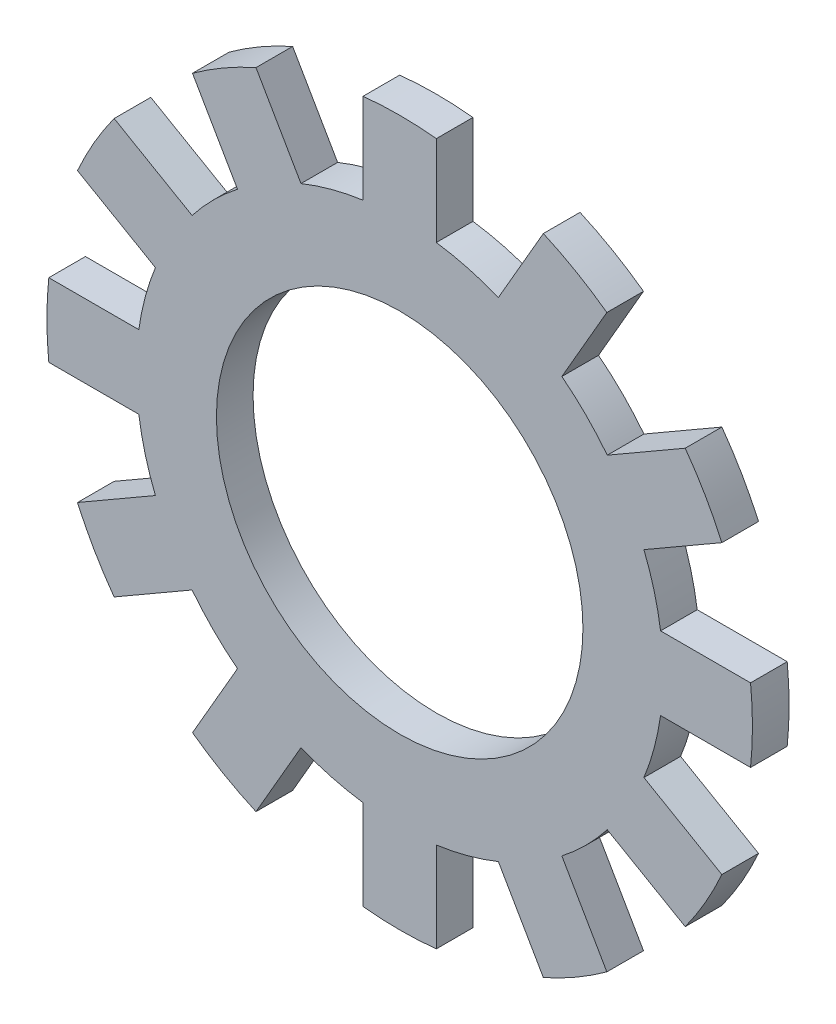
ISO-10303-21;
HEADER;
FILE_DESCRIPTION(('STEP AP214'),'2;1');
FILE_NAME('part.step','',(''),(''),'','','');
FILE_SCHEMA(('AUTOMOTIVE_DESIGN { 1 0 10303 214 1 1 1 1 }'));
ENDSEC;
DATA;
#1=APPLICATION_CONTEXT('core data for automotive mechanical design processes');
#2=APPLICATION_PROTOCOL_DEFINITION('international standard','automotive_design',2000,#1);
#3=PRODUCT_CONTEXT('',#1,'mechanical');
#4=PRODUCT('Part','Part','',(#3));
#5=PRODUCT_RELATED_PRODUCT_CATEGORY('part','',(#4));
#6=PRODUCT_DEFINITION_FORMATION('','',#4);
#7=PRODUCT_DEFINITION_CONTEXT('part definition',#1,'design');
#8=PRODUCT_DEFINITION('design','',#6,#7);
#9=PRODUCT_DEFINITION_SHAPE('','',#8);
#10=(LENGTH_UNIT() NAMED_UNIT(*) SI_UNIT(.MILLI.,.METRE.));
#11=(NAMED_UNIT(*) PLANE_ANGLE_UNIT() SI_UNIT($,.RADIAN.));
#12=(NAMED_UNIT(*) SI_UNIT($,.STERADIAN.) SOLID_ANGLE_UNIT());
#13=UNCERTAINTY_MEASURE_WITH_UNIT(LENGTH_MEASURE(1.E-05),#10,'distance_accuracy_value','');
#14=(GEOMETRIC_REPRESENTATION_CONTEXT(3) GLOBAL_UNCERTAINTY_ASSIGNED_CONTEXT((#13)) GLOBAL_UNIT_ASSIGNED_CONTEXT((#10,
#11,#12)) REPRESENTATION_CONTEXT('',''));
#15=CARTESIAN_POINT('',(0.,0.,0.));
#16=DIRECTION('',(0.,0.,1.));
#17=DIRECTION('',(1.,0.,0.));
#18=AXIS2_PLACEMENT_3D('',#15,#16,#17);
#19=CARTESIAN_POINT('',(0.,0.,0.4));
#20=DIRECTION('',(0.,0.,-1.));
#21=DIRECTION('',(-1.,0.,0.));
#22=AXIS2_PLACEMENT_3D('',#19,#20,#21);
#23=CYLINDRICAL_SURFACE('',#22,5.75);
#24=CARTESIAN_POINT('',(0.,0.,-0.4));
#25=DIRECTION('',(0.,0.,1.));
#26=DIRECTION('',(1.,0.,0.));
#27=AXIS2_PLACEMENT_3D('',#24,#25,#26);
#28=CIRCLE('',#27,5.75);
#29=CARTESIAN_POINT('',(4.53121435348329,3.53985825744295,-0.4));
#30=VERTEX_POINT('',#29);
#31=CARTESIAN_POINT('',(3.53985825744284,4.53121435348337,-0.4));
#32=VERTEX_POINT('',#31);
#33=EDGE_CURVE('E361',#30,#32,#28,.T.);
#34=ORIENTED_EDGE('',*,*,#33,.T.);
#35=DIRECTION('',(0.,0.,-1.));
#36=VECTOR('',#35,1.);
#37=CARTESIAN_POINT('',(3.53985825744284,4.53121435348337,0.4));
#38=LINE('',#37,#36);
#39=CARTESIAN_POINT('',(3.53985825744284,4.53121435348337,0.4));
#40=VERTEX_POINT('',#39);
#41=EDGE_CURVE('E352',#40,#32,#38,.T.);
#42=ORIENTED_EDGE('',*,*,#41,.F.);
#43=CARTESIAN_POINT('',(0.,0.,0.4));
#44=DIRECTION('',(0.,0.,1.));
#45=DIRECTION('',(1.,0.,0.));
#46=AXIS2_PLACEMENT_3D('',#43,#44,#45);
#47=CIRCLE('',#46,5.75);
#48=CARTESIAN_POINT('',(4.53121435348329,3.53985825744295,0.4));
#49=VERTEX_POINT('',#48);
#50=EDGE_CURVE('E64',#49,#40,#47,.T.);
#51=ORIENTED_EDGE('',*,*,#50,.F.);
#52=DIRECTION('',(0.,0.,-1.));
#53=VECTOR('',#52,1.);
#54=CARTESIAN_POINT('',(4.53121435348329,3.53985825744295,0.4));
#55=LINE('',#54,#53);
#56=EDGE_CURVE('E628',#49,#30,#55,.T.);
#57=ORIENTED_EDGE('',*,*,#56,.T.);
#58=EDGE_LOOP('',(#34,#42,#51,#57));
#59=FACE_BOUND('',#58,.T.);
#60=ADVANCED_FACE('F39',(#59),#23,.T.);
#61=DIRECTION('',(0.,0.,-1.));
#62=VECTOR('',#61,1.);
#63=CARTESIAN_POINT('',(2.15421761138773,5.33121435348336,0.4));
#64=LINE('',#63,#62);
#65=CARTESIAN_POINT('',(2.15421761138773,5.33121435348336,0.4));
#66=VERTEX_POINT('',#65);
#67=CARTESIAN_POINT('',(2.15421761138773,5.33121435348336,-0.4));
#68=VERTEX_POINT('',#67);
#69=EDGE_CURVE('E647',#66,#68,#64,.T.);
#70=ORIENTED_EDGE('',*,*,#69,.T.);
#71=CARTESIAN_POINT('',(0.8,5.69407586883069,-0.4));
#72=VERTEX_POINT('',#71);
#73=EDGE_CURVE('E388',#68,#72,#28,.T.);
#74=ORIENTED_EDGE('',*,*,#73,.T.);
#75=DIRECTION('',(0.,0.,-1.));
#76=VECTOR('',#75,1.);
#77=CARTESIAN_POINT('',(0.8,5.69407586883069,0.4));
#78=LINE('',#77,#76);
#79=CARTESIAN_POINT('',(0.8,5.69407586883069,0.4));
#80=VERTEX_POINT('',#79);
#81=EDGE_CURVE('E405',#80,#72,#78,.T.);
#82=ORIENTED_EDGE('',*,*,#81,.F.);
#83=EDGE_CURVE('E50',#66,#80,#47,.T.);
#84=ORIENTED_EDGE('',*,*,#83,.F.);
#85=EDGE_LOOP('',(#70,#74,#82,#84));
#86=FACE_BOUND('',#85,.T.);
#87=ADVANCED_FACE('F817',(#86),#23,.T.);
#88=CARTESIAN_POINT('',(5.69407586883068,0.800000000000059,-0.4));
#89=VERTEX_POINT('',#88);
#90=CARTESIAN_POINT('',(5.3312143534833,2.15421761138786,-0.4));
#91=VERTEX_POINT('',#90);
#92=EDGE_CURVE('E907',#89,#91,#28,.T.);
#93=ORIENTED_EDGE('',*,*,#92,.T.);
#94=DIRECTION('',(0.,0.,-1.));
#95=VECTOR('',#94,1.);
#96=CARTESIAN_POINT('',(5.3312143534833,2.15421761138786,0.4));
#97=LINE('',#96,#95);
#98=CARTESIAN_POINT('',(5.3312143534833,2.15421761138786,0.4));
#99=VERTEX_POINT('',#98);
#100=EDGE_CURVE('E786',#99,#91,#97,.T.);
#101=ORIENTED_EDGE('',*,*,#100,.F.);
#102=CARTESIAN_POINT('',(5.69407586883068,0.80000000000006,0.4));
#103=VERTEX_POINT('',#102);
#104=EDGE_CURVE('E371',#103,#99,#47,.T.);
#105=ORIENTED_EDGE('',*,*,#104,.F.);
#106=DIRECTION('',(0.,0.,-1.));
#107=VECTOR('',#106,1.);
#108=CARTESIAN_POINT('',(5.69407586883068,0.800000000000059,0.4));
#109=LINE('',#108,#107);
#110=EDGE_CURVE('E606',#103,#89,#109,.T.);
#111=ORIENTED_EDGE('',*,*,#110,.T.);
#112=EDGE_LOOP('',(#93,#101,#105,#111));
#113=FACE_BOUND('',#112,.T.);
#114=ADVANCED_FACE('F905',(#113),#23,.T.);
#115=CARTESIAN_POINT('',(5.33121435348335,-2.15421761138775,-0.4));
#116=VERTEX_POINT('',#115);
#117=CARTESIAN_POINT('',(5.6940758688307,-0.79999999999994,-0.4));
#118=VERTEX_POINT('',#117);
#119=EDGE_CURVE('E888',#116,#118,#28,.T.);
#120=ORIENTED_EDGE('',*,*,#119,.T.);
#121=DIRECTION('',(0.,0.,-1.));
#122=VECTOR('',#121,1.);
#123=CARTESIAN_POINT('',(5.6940758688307,-0.79999999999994,0.4));
#124=LINE('',#123,#122);
#125=CARTESIAN_POINT('',(5.6940758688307,-0.79999999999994,0.4));
#126=VERTEX_POINT('',#125);
#127=EDGE_CURVE('E772',#126,#118,#124,.T.);
#128=ORIENTED_EDGE('',*,*,#127,.F.);
#129=CARTESIAN_POINT('',(5.33121435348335,-2.15421761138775,0.4));
#130=VERTEX_POINT('',#129);
#131=EDGE_CURVE('E376',#130,#126,#47,.T.);
#132=ORIENTED_EDGE('',*,*,#131,.F.);
#133=DIRECTION('',(0.,0.,-1.));
#134=VECTOR('',#133,1.);
#135=CARTESIAN_POINT('',(5.33121435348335,-2.15421761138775,0.4));
#136=LINE('',#135,#134);
#137=EDGE_CURVE('E584',#130,#116,#136,.T.);
#138=ORIENTED_EDGE('',*,*,#137,.T.);
#139=EDGE_LOOP('',(#120,#128,#132,#138));
#140=FACE_BOUND('',#139,.T.);
#141=ADVANCED_FACE('F887',(#140),#23,.T.);
#142=CARTESIAN_POINT('',(3.53985825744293,-4.5312143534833,-0.4));
#143=VERTEX_POINT('',#142);
#144=CARTESIAN_POINT('',(4.53121435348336,-3.53985825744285,-0.4));
#145=VERTEX_POINT('',#144);
#146=EDGE_CURVE('E964',#143,#145,#28,.T.);
#147=ORIENTED_EDGE('',*,*,#146,.T.);
#148=DIRECTION('',(0.,0.,-1.));
#149=VECTOR('',#148,1.);
#150=CARTESIAN_POINT('',(4.53121435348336,-3.53985825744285,0.4));
#151=LINE('',#150,#149);
#152=CARTESIAN_POINT('',(4.53121435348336,-3.53985825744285,0.4));
#153=VERTEX_POINT('',#152);
#154=EDGE_CURVE('E758',#153,#145,#151,.T.);
#155=ORIENTED_EDGE('',*,*,#154,.F.);
#156=CARTESIAN_POINT('',(3.53985825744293,-4.5312143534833,0.4));
#157=VERTEX_POINT('',#156);
#158=EDGE_CURVE('E874',#157,#153,#47,.T.);
#159=ORIENTED_EDGE('',*,*,#158,.F.);
#160=DIRECTION('',(0.,0.,-1.));
#161=VECTOR('',#160,1.);
#162=CARTESIAN_POINT('',(3.53985825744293,-4.5312143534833,0.4));
#163=LINE('',#162,#161);
#164=EDGE_CURVE('E562',#157,#143,#163,.T.);
#165=ORIENTED_EDGE('',*,*,#164,.T.);
#166=EDGE_LOOP('',(#147,#155,#159,#165));
#167=FACE_BOUND('',#166,.T.);
#168=ADVANCED_FACE('F974',(#167),#23,.T.);
#169=CARTESIAN_POINT('',(0.8,-5.69407586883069,-0.4));
#170=VERTEX_POINT('',#169);
#171=CARTESIAN_POINT('',(2.15421761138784,-5.33121435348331,-0.4));
#172=VERTEX_POINT('',#171);
#173=EDGE_CURVE('E959',#170,#172,#28,.T.);
#174=ORIENTED_EDGE('',*,*,#173,.T.);
#175=DIRECTION('',(0.,0.,-1.));
#176=VECTOR('',#175,1.);
#177=CARTESIAN_POINT('',(2.15421761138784,-5.33121435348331,0.4));
#178=LINE('',#177,#176);
#179=CARTESIAN_POINT('',(2.15421761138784,-5.33121435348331,0.4));
#180=VERTEX_POINT('',#179);
#181=EDGE_CURVE('E744',#180,#172,#178,.T.);
#182=ORIENTED_EDGE('',*,*,#181,.F.);
#183=CARTESIAN_POINT('',(0.8,-5.69407586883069,0.4));
#184=VERTEX_POINT('',#183);
#185=EDGE_CURVE('E869',#184,#180,#47,.T.);
#186=ORIENTED_EDGE('',*,*,#185,.F.);
#187=DIRECTION('',(0.,0.,-1.));
#188=VECTOR('',#187,1.);
#189=CARTESIAN_POINT('',(0.8,-5.69407586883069,0.4));
#190=LINE('',#189,#188);
#191=EDGE_CURVE('E540',#184,#170,#190,.T.);
#192=ORIENTED_EDGE('',*,*,#191,.T.);
#193=EDGE_LOOP('',(#174,#182,#186,#192));
#194=FACE_BOUND('',#193,.T.);
#195=ADVANCED_FACE('F1402',(#194),#23,.T.);
#196=CARTESIAN_POINT('',(-2.15421761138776,-5.33121435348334,-0.4));
#197=VERTEX_POINT('',#196);
#198=CARTESIAN_POINT('',(-0.8,-5.69407586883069,-0.4));
#199=VERTEX_POINT('',#198);
#200=EDGE_CURVE('E955',#197,#199,#28,.T.);
#201=ORIENTED_EDGE('',*,*,#200,.T.);
#202=DIRECTION('',(0.,0.,-1.));
#203=VECTOR('',#202,1.);
#204=CARTESIAN_POINT('',(-0.8,-5.69407586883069,0.4));
#205=LINE('',#204,#203);
#206=CARTESIAN_POINT('',(-0.8,-5.69407586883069,0.4));
#207=VERTEX_POINT('',#206);
#208=EDGE_CURVE('E730',#207,#199,#205,.T.);
#209=ORIENTED_EDGE('',*,*,#208,.F.);
#210=CARTESIAN_POINT('',(-2.15421761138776,-5.33121435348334,0.4));
#211=VERTEX_POINT('',#210);
#212=EDGE_CURVE('E864',#211,#207,#47,.T.);
#213=ORIENTED_EDGE('',*,*,#212,.F.);
#214=DIRECTION('',(0.,0.,-1.));
#215=VECTOR('',#214,1.);
#216=CARTESIAN_POINT('',(-2.15421761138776,-5.33121435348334,0.4));
#217=LINE('',#216,#215);
#218=EDGE_CURVE('E518',#211,#197,#217,.T.);
#219=ORIENTED_EDGE('',*,*,#218,.T.);
#220=EDGE_LOOP('',(#201,#209,#213,#219));
#221=FACE_BOUND('',#220,.T.);
#222=ADVANCED_FACE('F1394',(#221),#23,.T.);
#223=CARTESIAN_POINT('',(-4.53121435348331,-3.53985825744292,-0.4));
#224=VERTEX_POINT('',#223);
#225=CARTESIAN_POINT('',(-3.53985825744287,-4.53121435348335,-0.4));
#226=VERTEX_POINT('',#225);
#227=EDGE_CURVE('E951',#224,#226,#28,.T.);
#228=ORIENTED_EDGE('',*,*,#227,.T.);
#229=DIRECTION('',(0.,0.,-1.));
#230=VECTOR('',#229,1.);
#231=CARTESIAN_POINT('',(-3.53985825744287,-4.53121435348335,0.4));
#232=LINE('',#231,#230);
#233=CARTESIAN_POINT('',(-3.53985825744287,-4.53121435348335,0.4));
#234=VERTEX_POINT('',#233);
#235=EDGE_CURVE('E716',#234,#226,#232,.T.);
#236=ORIENTED_EDGE('',*,*,#235,.F.);
#237=CARTESIAN_POINT('',(-4.53121435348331,-3.53985825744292,0.4));
#238=VERTEX_POINT('',#237);
#239=EDGE_CURVE('E859',#238,#234,#47,.T.);
#240=ORIENTED_EDGE('',*,*,#239,.F.);
#241=DIRECTION('',(0.,0.,-1.));
#242=VECTOR('',#241,1.);
#243=CARTESIAN_POINT('',(-4.53121435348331,-3.53985825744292,0.4));
#244=LINE('',#243,#242);
#245=EDGE_CURVE('E496',#238,#224,#244,.T.);
#246=ORIENTED_EDGE('',*,*,#245,.T.);
#247=EDGE_LOOP('',(#228,#236,#240,#246));
#248=FACE_BOUND('',#247,.T.);
#249=ADVANCED_FACE('F1386',(#248),#23,.T.);
#250=CARTESIAN_POINT('',(-5.69407586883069,-0.80000000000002,-0.4));
#251=VERTEX_POINT('',#250);
#252=CARTESIAN_POINT('',(-5.33121435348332,-2.15421761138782,-0.4));
#253=VERTEX_POINT('',#252);
#254=EDGE_CURVE('E947',#251,#253,#28,.T.);
#255=ORIENTED_EDGE('',*,*,#254,.T.);
#256=DIRECTION('',(0.,0.,-1.));
#257=VECTOR('',#256,1.);
#258=CARTESIAN_POINT('',(-5.33121435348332,-2.15421761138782,0.4));
#259=LINE('',#258,#257);
#260=CARTESIAN_POINT('',(-5.33121435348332,-2.15421761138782,0.4));
#261=VERTEX_POINT('',#260);
#262=EDGE_CURVE('E703',#261,#253,#259,.T.);
#263=ORIENTED_EDGE('',*,*,#262,.F.);
#264=CARTESIAN_POINT('',(-5.69407586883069,-0.80000000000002,0.4));
#265=VERTEX_POINT('',#264);
#266=EDGE_CURVE('E855',#265,#261,#47,.T.);
#267=ORIENTED_EDGE('',*,*,#266,.F.);
#268=DIRECTION('',(0.,0.,-1.));
#269=VECTOR('',#268,1.);
#270=CARTESIAN_POINT('',(-5.69407586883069,-0.80000000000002,0.4));
#271=LINE('',#270,#269);
#272=EDGE_CURVE('E474',#265,#251,#271,.T.);
#273=ORIENTED_EDGE('',*,*,#272,.T.);
#274=EDGE_LOOP('',(#255,#263,#267,#273));
#275=FACE_BOUND('',#274,.T.);
#276=ADVANCED_FACE('F940',(#275),#23,.T.);
#277=CARTESIAN_POINT('',(-5.33121435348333,2.15421761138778,-0.4));
#278=VERTEX_POINT('',#277);
#279=CARTESIAN_POINT('',(-5.69407586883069,0.79999999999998,-0.4));
#280=VERTEX_POINT('',#279);
#281=EDGE_CURVE('E944',#278,#280,#28,.T.);
#282=ORIENTED_EDGE('',*,*,#281,.T.);
#283=DIRECTION('',(0.,0.,-1.));
#284=VECTOR('',#283,1.);
#285=CARTESIAN_POINT('',(-5.69407586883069,0.79999999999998,0.4));
#286=LINE('',#285,#284);
#287=CARTESIAN_POINT('',(-5.69407586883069,0.79999999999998,0.4));
#288=VERTEX_POINT('',#287);
#289=EDGE_CURVE('E689',#288,#280,#286,.T.);
#290=ORIENTED_EDGE('',*,*,#289,.F.);
#291=CARTESIAN_POINT('',(-5.33121435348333,2.15421761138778,0.4));
#292=VERTEX_POINT('',#291);
#293=EDGE_CURVE('E852',#292,#288,#47,.T.);
#294=ORIENTED_EDGE('',*,*,#293,.F.);
#295=DIRECTION('',(0.,0.,-1.));
#296=VECTOR('',#295,1.);
#297=CARTESIAN_POINT('',(-5.33121435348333,2.15421761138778,0.4));
#298=LINE('',#297,#296);
#299=EDGE_CURVE('E452',#292,#278,#298,.T.);
#300=ORIENTED_EDGE('',*,*,#299,.T.);
#301=EDGE_LOOP('',(#282,#290,#294,#300));
#302=FACE_BOUND('',#301,.T.);
#303=ADVANCED_FACE('F936',(#302),#23,.T.);
#304=CARTESIAN_POINT('',(-3.5398582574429,4.53121435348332,-0.4));
#305=VERTEX_POINT('',#304);
#306=CARTESIAN_POINT('',(-4.53121435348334,3.53985825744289,-0.4));
#307=VERTEX_POINT('',#306);
#308=EDGE_CURVE('E943',#305,#307,#28,.T.);
#309=ORIENTED_EDGE('',*,*,#308,.T.);
#310=DIRECTION('',(0.,0.,-1.));
#311=VECTOR('',#310,1.);
#312=CARTESIAN_POINT('',(-4.53121435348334,3.53985825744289,0.4));
#313=LINE('',#312,#311);
#314=CARTESIAN_POINT('',(-4.53121435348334,3.53985825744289,0.4));
#315=VERTEX_POINT('',#314);
#316=EDGE_CURVE('E675',#315,#307,#313,.T.);
#317=ORIENTED_EDGE('',*,*,#316,.F.);
#318=CARTESIAN_POINT('',(-3.5398582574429,4.53121435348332,0.4));
#319=VERTEX_POINT('',#318);
#320=EDGE_CURVE('E49',#319,#315,#47,.T.);
#321=ORIENTED_EDGE('',*,*,#320,.F.);
#322=DIRECTION('',(0.,0.,-1.));
#323=VECTOR('',#322,1.);
#324=CARTESIAN_POINT('',(-3.5398582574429,4.53121435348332,0.4));
#325=LINE('',#324,#323);
#326=EDGE_CURVE('E430',#319,#305,#325,.T.);
#327=ORIENTED_EDGE('',*,*,#326,.T.);
#328=EDGE_LOOP('',(#309,#317,#321,#327));
#329=FACE_BOUND('',#328,.T.);
#330=ADVANCED_FACE('F930',(#329),#23,.T.);
#331=CARTESIAN_POINT('',(-0.8,5.69407586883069,-0.4));
#332=VERTEX_POINT('',#331);
#333=CARTESIAN_POINT('',(-2.1542176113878,5.33121435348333,-0.4));
#334=VERTEX_POINT('',#333);
#335=EDGE_CURVE('E43',#332,#334,#28,.T.);
#336=ORIENTED_EDGE('',*,*,#335,.T.);
#337=DIRECTION('',(0.,0.,-1.));
#338=VECTOR('',#337,1.);
#339=CARTESIAN_POINT('',(-2.1542176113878,5.33121435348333,0.4));
#340=LINE('',#339,#338);
#341=CARTESIAN_POINT('',(-2.1542176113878,5.33121435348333,0.4));
#342=VERTEX_POINT('',#341);
#343=EDGE_CURVE('E659',#342,#334,#340,.T.);
#344=ORIENTED_EDGE('',*,*,#343,.F.);
#345=CARTESIAN_POINT('',(-0.8,5.69407586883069,0.4));
#346=VERTEX_POINT('',#345);
#347=EDGE_CURVE('E11',#346,#342,#47,.T.);
#348=ORIENTED_EDGE('',*,*,#347,.F.);
#349=DIRECTION('',(0.,0.,-1.));
#350=VECTOR('',#349,1.);
#351=CARTESIAN_POINT('',(-0.8,5.69407586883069,0.4));
#352=LINE('',#351,#350);
#353=EDGE_CURVE('E392',#346,#332,#352,.T.);
#354=ORIENTED_EDGE('',*,*,#353,.T.);
#355=EDGE_LOOP('',(#336,#344,#348,#354));
#356=FACE_BOUND('',#355,.T.);
#357=ADVANCED_FACE('F41',(#356),#23,.T.);
#358=CARTESIAN_POINT('',(0.,0.,0.4));
#359=DIRECTION('',(0.,0.,1.));
#360=DIRECTION('',(1.,0.,0.));
#361=AXIS2_PLACEMENT_3D('',#358,#359,#360);
#362=PLANE('',#361);
#363=ORIENTED_EDGE('',*,*,#347,.T.);
#364=DIRECTION('',(0.500000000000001,-0.866025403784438,0.));
#365=VECTOR('',#364,1.);
#366=CARTESIAN_POINT('',(-3.13634407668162,7.03230729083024,0.4));
#367=LINE('',#366,#365);
#368=CARTESIAN_POINT('',(-3.13634407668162,7.03230729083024,0.4));
#369=VERTEX_POINT('',#368);
#370=EDGE_CURVE('E670',#369,#342,#367,.T.);
#371=ORIENTED_EDGE('',*,*,#370,.F.);
#372=CARTESIAN_POINT('',(0.,0.,0.4));
#373=DIRECTION('',(0.,0.,1.));
#374=DIRECTION('',(0.866025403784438,0.500000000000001,0.));
#375=AXIS2_PLACEMENT_3D('',#372,#373,#374);
#376=CIRCLE('',#375,7.7);
#377=CARTESIAN_POINT('',(-4.52198472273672,6.23230729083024,0.4));
#378=VERTEX_POINT('',#377);
#379=EDGE_CURVE('E439',#369,#378,#376,.T.);
#380=ORIENTED_EDGE('',*,*,#379,.T.);
#381=DIRECTION('',(0.500000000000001,-0.866025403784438,0.));
#382=VECTOR('',#381,1.);
#383=CARTESIAN_POINT('',(-4.52198472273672,6.23230729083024,0.4));
#384=LINE('',#383,#382);
#385=EDGE_CURVE('E434',#378,#319,#384,.T.);
#386=ORIENTED_EDGE('',*,*,#385,.T.);
#387=ORIENTED_EDGE('',*,*,#320,.T.);
#388=DIRECTION('',(0.86602540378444,-0.499999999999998,0.));
#389=VECTOR('',#388,1.);
#390=CARTESIAN_POINT('',(-6.23230729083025,4.5219847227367,0.4));
#391=LINE('',#390,#389);
#392=CARTESIAN_POINT('',(-6.23230729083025,4.5219847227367,0.4));
#393=VERTEX_POINT('',#392);
#394=EDGE_CURVE('E684',#393,#315,#391,.T.);
#395=ORIENTED_EDGE('',*,*,#394,.F.);
#396=CARTESIAN_POINT('',(0.,0.,0.4));
#397=DIRECTION('',(0.,0.,1.));
#398=DIRECTION('',(0.499999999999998,0.86602540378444,0.));
#399=AXIS2_PLACEMENT_3D('',#396,#397,#398);
#400=CIRCLE('',#399,7.7);
#401=CARTESIAN_POINT('',(-7.03230729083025,3.13634407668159,0.4));
#402=VERTEX_POINT('',#401);
#403=EDGE_CURVE('E461',#393,#402,#400,.T.);
#404=ORIENTED_EDGE('',*,*,#403,.T.);
#405=DIRECTION('',(0.86602540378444,-0.499999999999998,0.));
#406=VECTOR('',#405,1.);
#407=CARTESIAN_POINT('',(-7.03230729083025,3.13634407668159,0.4));
#408=LINE('',#407,#406);
#409=EDGE_CURVE('E456',#402,#292,#408,.T.);
#410=ORIENTED_EDGE('',*,*,#409,.T.);
#411=ORIENTED_EDGE('',*,*,#293,.T.);
#412=DIRECTION('',(1.,0.,0.));
#413=VECTOR('',#412,1.);
#414=CARTESIAN_POINT('',(-7.65832879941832,0.799999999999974,0.4));
#415=LINE('',#414,#413);
#416=CARTESIAN_POINT('',(-7.65832879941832,0.799999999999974,0.4));
#417=VERTEX_POINT('',#416);
#418=EDGE_CURVE('E698',#417,#288,#415,.T.);
#419=ORIENTED_EDGE('',*,*,#418,.F.);
#420=CARTESIAN_POINT('',(0.,0.,0.4));
#421=DIRECTION('',(0.,0.,1.));
#422=DIRECTION('',(0.,1.,0.));
#423=AXIS2_PLACEMENT_3D('',#420,#421,#422);
#424=CIRCLE('',#423,7.7);
#425=CARTESIAN_POINT('',(-7.65832879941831,-0.800000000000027,0.4));
#426=VERTEX_POINT('',#425);
#427=EDGE_CURVE('E483',#417,#426,#424,.T.);
#428=ORIENTED_EDGE('',*,*,#427,.T.);
#429=DIRECTION('',(1.,0.,0.));
#430=VECTOR('',#429,1.);
#431=CARTESIAN_POINT('',(-7.65832879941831,-0.800000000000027,0.4));
#432=LINE('',#431,#430);
#433=EDGE_CURVE('E478',#426,#265,#432,.T.);
#434=ORIENTED_EDGE('',*,*,#433,.T.);
#435=ORIENTED_EDGE('',*,*,#266,.T.);
#436=DIRECTION('',(0.866025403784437,0.500000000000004,0.));
#437=VECTOR('',#436,1.);
#438=CARTESIAN_POINT('',(-7.03230729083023,-3.13634407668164,0.4));
#439=LINE('',#438,#437);
#440=CARTESIAN_POINT('',(-7.03230729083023,-3.13634407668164,0.4));
#441=VERTEX_POINT('',#440);
#442=EDGE_CURVE('E711',#441,#261,#439,.T.);
#443=ORIENTED_EDGE('',*,*,#442,.F.);
#444=CARTESIAN_POINT('',(0.,0.,0.4));
#445=DIRECTION('',(0.,0.,1.));
#446=DIRECTION('',(-0.500000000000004,0.866025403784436,0.));
#447=AXIS2_PLACEMENT_3D('',#444,#445,#446);
#448=CIRCLE('',#447,7.7);
#449=CARTESIAN_POINT('',(-6.23230729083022,-4.52198472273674,0.4));
#450=VERTEX_POINT('',#449);
#451=EDGE_CURVE('E505',#441,#450,#448,.T.);
#452=ORIENTED_EDGE('',*,*,#451,.T.);
#453=DIRECTION('',(0.866025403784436,0.500000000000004,0.));
#454=VECTOR('',#453,1.);
#455=CARTESIAN_POINT('',(-6.23230729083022,-4.52198472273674,0.4));
#456=LINE('',#455,#454);
#457=EDGE_CURVE('E500',#450,#238,#456,.T.);
#458=ORIENTED_EDGE('',*,*,#457,.T.);
#459=ORIENTED_EDGE('',*,*,#239,.T.);
#460=DIRECTION('',(0.499999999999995,0.866025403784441,0.));
#461=VECTOR('',#460,1.);
#462=CARTESIAN_POINT('',(-4.52198472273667,-6.23230729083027,0.4));
#463=LINE('',#462,#461);
#464=CARTESIAN_POINT('',(-4.52198472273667,-6.23230729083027,0.4));
#465=VERTEX_POINT('',#464);
#466=EDGE_CURVE('E725',#465,#234,#463,.T.);
#467=ORIENTED_EDGE('',*,*,#466,.F.);
#468=CARTESIAN_POINT('',(0.,0.,0.4));
#469=DIRECTION('',(0.,0.,1.));
#470=DIRECTION('',(-0.866025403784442,0.499999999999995,0.));
#471=AXIS2_PLACEMENT_3D('',#468,#469,#470);
#472=CIRCLE('',#471,7.7);
#473=CARTESIAN_POINT('',(-3.13634407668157,-7.03230729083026,0.4));
#474=VERTEX_POINT('',#473);
#475=EDGE_CURVE('E527',#465,#474,#472,.T.);
#476=ORIENTED_EDGE('',*,*,#475,.T.);
#477=DIRECTION('',(0.499999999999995,0.866025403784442,0.));
#478=VECTOR('',#477,1.);
#479=CARTESIAN_POINT('',(-3.13634407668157,-7.03230729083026,0.4));
#480=LINE('',#479,#478);
#481=EDGE_CURVE('E522',#474,#211,#480,.T.);
#482=ORIENTED_EDGE('',*,*,#481,.T.);
#483=ORIENTED_EDGE('',*,*,#212,.T.);
#484=DIRECTION('',(0.,1.,0.));
#485=VECTOR('',#484,1.);
#486=CARTESIAN_POINT('',(-0.8,-7.65832879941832,0.4));
#487=LINE('',#486,#485);
#488=CARTESIAN_POINT('',(-0.8,-7.65832879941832,0.4));
#489=VERTEX_POINT('',#488);
#490=EDGE_CURVE('E739',#489,#207,#487,.T.);
#491=ORIENTED_EDGE('',*,*,#490,.F.);
#492=CARTESIAN_POINT('',(0.,0.,0.4));
#493=DIRECTION('',(0.,0.,1.));
#494=DIRECTION('',(-1.,0.,0.));
#495=AXIS2_PLACEMENT_3D('',#492,#493,#494);
#496=CIRCLE('',#495,7.7);
#497=CARTESIAN_POINT('',(0.8,-7.65832879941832,0.4));
#498=VERTEX_POINT('',#497);
#499=EDGE_CURVE('E549',#489,#498,#496,.T.);
#500=ORIENTED_EDGE('',*,*,#499,.T.);
#501=DIRECTION('',(0.,1.,0.));
#502=VECTOR('',#501,1.);
#503=CARTESIAN_POINT('',(0.8,-7.65832879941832,0.4));
#504=LINE('',#503,#502);
#505=EDGE_CURVE('E544',#498,#184,#504,.T.);
#506=ORIENTED_EDGE('',*,*,#505,.T.);
#507=ORIENTED_EDGE('',*,*,#185,.T.);
#508=DIRECTION('',(-0.500000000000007,0.866025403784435,0.));
#509=VECTOR('',#508,1.);
#510=CARTESIAN_POINT('',(3.13634407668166,-7.03230729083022,0.4));
#511=LINE('',#510,#509);
#512=CARTESIAN_POINT('',(3.13634407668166,-7.03230729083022,0.4));
#513=VERTEX_POINT('',#512);
#514=EDGE_CURVE('E753',#513,#180,#511,.T.);
#515=ORIENTED_EDGE('',*,*,#514,.F.);
#516=CARTESIAN_POINT('',(0.,0.,0.4));
#517=DIRECTION('',(0.,0.,1.));
#518=DIRECTION('',(-0.866025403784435,-0.500000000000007,0.));
#519=AXIS2_PLACEMENT_3D('',#516,#517,#518);
#520=CIRCLE('',#519,7.7);
#521=CARTESIAN_POINT('',(4.52198472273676,-6.23230729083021,0.4));
#522=VERTEX_POINT('',#521);
#523=EDGE_CURVE('E571',#513,#522,#520,.T.);
#524=ORIENTED_EDGE('',*,*,#523,.T.);
#525=DIRECTION('',(-0.500000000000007,0.866025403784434,0.));
#526=VECTOR('',#525,1.);
#527=CARTESIAN_POINT('',(4.52198472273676,-6.23230729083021,0.4));
#528=LINE('',#527,#526);
#529=EDGE_CURVE('E566',#522,#157,#528,.T.);
#530=ORIENTED_EDGE('',*,*,#529,.T.);
#531=ORIENTED_EDGE('',*,*,#158,.T.);
#532=DIRECTION('',(-0.866025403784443,0.499999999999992,0.));
#533=VECTOR('',#532,1.);
#534=CARTESIAN_POINT('',(6.23230729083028,-4.52198472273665,0.4));
#535=LINE('',#534,#533);
#536=CARTESIAN_POINT('',(6.23230729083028,-4.52198472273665,0.4));
#537=VERTEX_POINT('',#536);
#538=EDGE_CURVE('E767',#537,#153,#535,.T.);
#539=ORIENTED_EDGE('',*,*,#538,.F.);
#540=CARTESIAN_POINT('',(0.,0.,0.4));
#541=DIRECTION('',(0.,0.,1.));
#542=DIRECTION('',(-0.499999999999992,-0.866025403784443,0.));
#543=AXIS2_PLACEMENT_3D('',#540,#541,#542);
#544=CIRCLE('',#543,7.7);
#545=CARTESIAN_POINT('',(7.03230729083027,-3.13634407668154,0.4));
#546=VERTEX_POINT('',#545);
#547=EDGE_CURVE('E593',#537,#546,#544,.T.);
#548=ORIENTED_EDGE('',*,*,#547,.T.);
#549=DIRECTION('',(-0.866025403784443,0.499999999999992,0.));
#550=VECTOR('',#549,1.);
#551=CARTESIAN_POINT('',(7.03230729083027,-3.13634407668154,0.4));
#552=LINE('',#551,#550);
#553=EDGE_CURVE('E588',#546,#130,#552,.T.);
#554=ORIENTED_EDGE('',*,*,#553,.T.);
#555=ORIENTED_EDGE('',*,*,#131,.T.);
#556=DIRECTION('',(-1.,0.,0.));
#557=VECTOR('',#556,1.);
#558=CARTESIAN_POINT('',(7.65832879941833,-0.79999999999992,0.4));
#559=LINE('',#558,#557);
#560=CARTESIAN_POINT('',(7.65832879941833,-0.79999999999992,0.4));
#561=VERTEX_POINT('',#560);
#562=EDGE_CURVE('E781',#561,#126,#559,.T.);
#563=ORIENTED_EDGE('',*,*,#562,.F.);
#564=CARTESIAN_POINT('',(0.,0.,0.4));
#565=DIRECTION('',(0.,0.,1.));
#566=DIRECTION('',(0.,-1.,0.));
#567=AXIS2_PLACEMENT_3D('',#564,#565,#566);
#568=CIRCLE('',#567,7.7);
#569=CARTESIAN_POINT('',(7.65832879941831,0.800000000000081,0.4));
#570=VERTEX_POINT('',#569);
#571=EDGE_CURVE('E615',#561,#570,#568,.T.);
#572=ORIENTED_EDGE('',*,*,#571,.T.);
#573=DIRECTION('',(-1.,0.,0.));
#574=VECTOR('',#573,1.);
#575=CARTESIAN_POINT('',(7.65832879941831,0.800000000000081,0.4));
#576=LINE('',#575,#574);
#577=EDGE_CURVE('E610',#570,#103,#576,.T.);
#578=ORIENTED_EDGE('',*,*,#577,.T.);
#579=ORIENTED_EDGE('',*,*,#104,.T.);
#580=DIRECTION('',(-0.866025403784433,-0.50000000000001,0.));
#581=VECTOR('',#580,1.);
#582=CARTESIAN_POINT('',(7.03230729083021,3.13634407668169,0.4));
#583=LINE('',#582,#581);
#584=CARTESIAN_POINT('',(7.03230729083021,3.13634407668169,0.4));
#585=VERTEX_POINT('',#584);
#586=EDGE_CURVE('E795',#585,#99,#583,.T.);
#587=ORIENTED_EDGE('',*,*,#586,.F.);
#588=CARTESIAN_POINT('',(0.,0.,0.4));
#589=DIRECTION('',(0.,0.,1.));
#590=DIRECTION('',(0.50000000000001,-0.866025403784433,0.));
#591=AXIS2_PLACEMENT_3D('',#588,#589,#590);
#592=CIRCLE('',#591,7.7);
#593=CARTESIAN_POINT('',(6.23230729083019,4.52198472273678,0.4));
#594=VERTEX_POINT('',#593);
#595=EDGE_CURVE('E635',#585,#594,#592,.T.);
#596=ORIENTED_EDGE('',*,*,#595,.T.);
#597=DIRECTION('',(-0.866025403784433,-0.50000000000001,0.));
#598=VECTOR('',#597,1.);
#599=CARTESIAN_POINT('',(6.23230729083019,4.52198472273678,0.4));
#600=LINE('',#599,#598);
#601=EDGE_CURVE('E368',#594,#49,#600,.T.);
#602=ORIENTED_EDGE('',*,*,#601,.T.);
#603=ORIENTED_EDGE('',*,*,#50,.T.);
#604=DIRECTION('',(-0.499999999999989,-0.866025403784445,0.));
#605=VECTOR('',#604,1.);
#606=CARTESIAN_POINT('',(4.52198472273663,6.2323072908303,0.4));
#607=LINE('',#606,#605);
#608=CARTESIAN_POINT('',(4.52198472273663,6.2323072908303,0.4));
#609=VERTEX_POINT('',#608);
#610=EDGE_CURVE('E349',#609,#40,#607,.T.);
#611=ORIENTED_EDGE('',*,*,#610,.F.);
#612=CARTESIAN_POINT('',(0.,0.,0.4));
#613=DIRECTION('',(0.,0.,1.));
#614=DIRECTION('',(0.866025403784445,-0.499999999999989,0.));
#615=AXIS2_PLACEMENT_3D('',#612,#613,#614);
#616=CIRCLE('',#615,7.7);
#617=CARTESIAN_POINT('',(3.13634407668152,7.03230729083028,0.4));
#618=VERTEX_POINT('',#617);
#619=EDGE_CURVE('E655',#609,#618,#616,.T.);
#620=ORIENTED_EDGE('',*,*,#619,.T.);
#621=DIRECTION('',(-0.499999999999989,-0.866025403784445,0.));
#622=VECTOR('',#621,1.);
#623=CARTESIAN_POINT('',(3.13634407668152,7.03230729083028,0.4));
#624=LINE('',#623,#622);
#625=EDGE_CURVE('E650',#618,#66,#624,.T.);
#626=ORIENTED_EDGE('',*,*,#625,.T.);
#627=ORIENTED_EDGE('',*,*,#83,.T.);
#628=DIRECTION('',(0.,-1.,0.));
#629=VECTOR('',#628,1.);
#630=CARTESIAN_POINT('',(0.8,7.65832879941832,0.4));
#631=LINE('',#630,#629);
#632=CARTESIAN_POINT('',(0.8,7.65832879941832,0.4));
#633=VERTEX_POINT('',#632);
#634=EDGE_CURVE('E418',#633,#80,#631,.T.);
#635=ORIENTED_EDGE('',*,*,#634,.F.);
#636=CARTESIAN_POINT('',(0.,0.,0.4));
#637=DIRECTION('',(0.,0.,1.));
#638=DIRECTION('',(1.,0.,0.));
#639=AXIS2_PLACEMENT_3D('',#636,#637,#638);
#640=CIRCLE('',#639,7.7);
#641=CARTESIAN_POINT('',(-0.8,7.65832879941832,0.4));
#642=VERTEX_POINT('',#641);
#643=EDGE_CURVE('E401',#633,#642,#640,.T.);
#644=ORIENTED_EDGE('',*,*,#643,.T.);
#645=DIRECTION('',(0.,-1.,0.));
#646=VECTOR('',#645,1.);
#647=CARTESIAN_POINT('',(-0.8,7.65832879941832,0.4));
#648=LINE('',#647,#646);
#649=EDGE_CURVE('E396',#642,#346,#648,.T.);
#650=ORIENTED_EDGE('',*,*,#649,.T.);
#651=EDGE_LOOP('',(#363,#371,#380,#386,#387,#395,#404,#410,#411,#419,#428,#434,#435,#443,#452,
#458,#459,#467,#476,#482,#483,#491,#500,#506,#507,#515,#524,#530,#531,#539,#548,#554,#555,#563,
#572,#578,#579,#587,#596,#602,#603,#611,#620,#626,#627,#635,#644,#650));
#652=FACE_BOUND('',#651,.T.);
#653=CARTESIAN_POINT('',(0.,0.,0.4));
#654=DIRECTION('',(0.,0.,1.));
#655=DIRECTION('',(1.,0.,0.));
#656=AXIS2_PLACEMENT_3D('',#653,#654,#655);
#657=CIRCLE('',#656,4.);
#658=CARTESIAN_POINT('',(4.,0.,0.4));
#659=VERTEX_POINT('',#658);
#660=EDGE_CURVE('E383',#659,#659,#657,.T.);
#661=ORIENTED_EDGE('',*,*,#660,.F.);
#662=EDGE_LOOP('',(#661));
#663=FACE_BOUND('',#662,.T.);
#664=ADVANCED_FACE('F365',(#652,#663),#362,.T.);
#665=CARTESIAN_POINT('',(0.,0.,-0.4));
#666=DIRECTION('',(0.,0.,1.));
#667=DIRECTION('',(1.,0.,0.));
#668=AXIS2_PLACEMENT_3D('',#665,#666,#667);
#669=PLANE('',#668);
#670=ORIENTED_EDGE('',*,*,#335,.F.);
#671=DIRECTION('',(0.,-1.,0.));
#672=VECTOR('',#671,1.);
#673=CARTESIAN_POINT('',(-0.8,7.65832879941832,-0.4));
#674=LINE('',#673,#672);
#675=CARTESIAN_POINT('',(-0.8,7.65832879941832,-0.4));
#676=VERTEX_POINT('',#675);
#677=EDGE_CURVE('E397',#676,#332,#674,.T.);
#678=ORIENTED_EDGE('',*,*,#677,.F.);
#679=CARTESIAN_POINT('',(0.,0.,-0.4));
#680=DIRECTION('',(0.,0.,1.));
#681=DIRECTION('',(1.,0.,0.));
#682=AXIS2_PLACEMENT_3D('',#679,#680,#681);
#683=CIRCLE('',#682,7.7);
#684=CARTESIAN_POINT('',(0.8,7.65832879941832,-0.4));
#685=VERTEX_POINT('',#684);
#686=EDGE_CURVE('E402',#685,#676,#683,.T.);
#687=ORIENTED_EDGE('',*,*,#686,.F.);
#688=DIRECTION('',(0.,-1.,0.));
#689=VECTOR('',#688,1.);
#690=CARTESIAN_POINT('',(0.8,7.65832879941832,-0.4));
#691=LINE('',#690,#689);
#692=EDGE_CURVE('E419',#685,#72,#691,.T.);
#693=ORIENTED_EDGE('',*,*,#692,.T.);
#694=ORIENTED_EDGE('',*,*,#73,.F.);
#695=DIRECTION('',(-0.499999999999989,-0.866025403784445,0.));
#696=VECTOR('',#695,1.);
#697=CARTESIAN_POINT('',(3.13634407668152,7.03230729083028,-0.4));
#698=LINE('',#697,#696);
#699=CARTESIAN_POINT('',(3.13634407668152,7.03230729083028,-0.4));
#700=VERTEX_POINT('',#699);
#701=EDGE_CURVE('E651',#700,#68,#698,.T.);
#702=ORIENTED_EDGE('',*,*,#701,.F.);
#703=CARTESIAN_POINT('',(0.,0.,-0.4));
#704=DIRECTION('',(0.,0.,1.));
#705=DIRECTION('',(0.866025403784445,-0.499999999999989,0.));
#706=AXIS2_PLACEMENT_3D('',#703,#704,#705);
#707=CIRCLE('',#706,7.7);
#708=CARTESIAN_POINT('',(4.52198472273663,6.2323072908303,-0.4));
#709=VERTEX_POINT('',#708);
#710=EDGE_CURVE('E656',#709,#700,#707,.T.);
#711=ORIENTED_EDGE('',*,*,#710,.F.);
#712=DIRECTION('',(-0.499999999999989,-0.866025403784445,0.));
#713=VECTOR('',#712,1.);
#714=CARTESIAN_POINT('',(4.52198472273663,6.2323072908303,-0.4));
#715=LINE('',#714,#713);
#716=EDGE_CURVE('E358',#709,#32,#715,.T.);
#717=ORIENTED_EDGE('',*,*,#716,.T.);
#718=ORIENTED_EDGE('',*,*,#33,.F.);
#719=DIRECTION('',(-0.866025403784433,-0.50000000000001,0.));
#720=VECTOR('',#719,1.);
#721=CARTESIAN_POINT('',(6.23230729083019,4.52198472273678,-0.4));
#722=LINE('',#721,#720);
#723=CARTESIAN_POINT('',(6.23230729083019,4.52198472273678,-0.4));
#724=VERTEX_POINT('',#723);
#725=EDGE_CURVE('E631',#724,#30,#722,.T.);
#726=ORIENTED_EDGE('',*,*,#725,.F.);
#727=CARTESIAN_POINT('',(0.,0.,-0.4));
#728=DIRECTION('',(0.,0.,1.));
#729=DIRECTION('',(0.50000000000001,-0.866025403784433,0.));
#730=AXIS2_PLACEMENT_3D('',#727,#728,#729);
#731=CIRCLE('',#730,7.7);
#732=CARTESIAN_POINT('',(7.03230729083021,3.13634407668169,-0.4));
#733=VERTEX_POINT('',#732);
#734=EDGE_CURVE('E636',#733,#724,#731,.T.);
#735=ORIENTED_EDGE('',*,*,#734,.F.);
#736=DIRECTION('',(-0.866025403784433,-0.50000000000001,0.));
#737=VECTOR('',#736,1.);
#738=CARTESIAN_POINT('',(7.03230729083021,3.13634407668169,-0.4));
#739=LINE('',#738,#737);
#740=EDGE_CURVE('E363',#733,#91,#739,.T.);
#741=ORIENTED_EDGE('',*,*,#740,.T.);
#742=ORIENTED_EDGE('',*,*,#92,.F.);
#743=DIRECTION('',(-1.,0.,0.));
#744=VECTOR('',#743,1.);
#745=CARTESIAN_POINT('',(7.65832879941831,0.800000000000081,-0.4));
#746=LINE('',#745,#744);
#747=CARTESIAN_POINT('',(7.65832879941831,0.800000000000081,-0.4));
#748=VERTEX_POINT('',#747);
#749=EDGE_CURVE('E611',#748,#89,#746,.T.);
#750=ORIENTED_EDGE('',*,*,#749,.F.);
#751=CARTESIAN_POINT('',(0.,0.,-0.4));
#752=DIRECTION('',(0.,0.,1.));
#753=DIRECTION('',(0.,-1.,0.));
#754=AXIS2_PLACEMENT_3D('',#751,#752,#753);
#755=CIRCLE('',#754,7.7);
#756=CARTESIAN_POINT('',(7.65832879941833,-0.79999999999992,-0.4));
#757=VERTEX_POINT('',#756);
#758=EDGE_CURVE('E616',#757,#748,#755,.T.);
#759=ORIENTED_EDGE('',*,*,#758,.F.);
#760=DIRECTION('',(-1.,0.,0.));
#761=VECTOR('',#760,1.);
#762=CARTESIAN_POINT('',(7.65832879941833,-0.79999999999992,-0.4));
#763=LINE('',#762,#761);
#764=EDGE_CURVE('E782',#757,#118,#763,.T.);
#765=ORIENTED_EDGE('',*,*,#764,.T.);
#766=ORIENTED_EDGE('',*,*,#119,.F.);
#767=DIRECTION('',(-0.866025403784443,0.499999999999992,0.));
#768=VECTOR('',#767,1.);
#769=CARTESIAN_POINT('',(7.03230729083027,-3.13634407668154,-0.4));
#770=LINE('',#769,#768);
#771=CARTESIAN_POINT('',(7.03230729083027,-3.13634407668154,-0.4));
#772=VERTEX_POINT('',#771);
#773=EDGE_CURVE('E589',#772,#116,#770,.T.);
#774=ORIENTED_EDGE('',*,*,#773,.F.);
#775=CARTESIAN_POINT('',(0.,0.,-0.4));
#776=DIRECTION('',(0.,0.,1.));
#777=DIRECTION('',(-0.499999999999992,-0.866025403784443,0.));
#778=AXIS2_PLACEMENT_3D('',#775,#776,#777);
#779=CIRCLE('',#778,7.7);
#780=CARTESIAN_POINT('',(6.23230729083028,-4.52198472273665,-0.4));
#781=VERTEX_POINT('',#780);
#782=EDGE_CURVE('E594',#781,#772,#779,.T.);
#783=ORIENTED_EDGE('',*,*,#782,.F.);
#784=DIRECTION('',(-0.866025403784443,0.499999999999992,0.));
#785=VECTOR('',#784,1.);
#786=CARTESIAN_POINT('',(6.23230729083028,-4.52198472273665,-0.4));
#787=LINE('',#786,#785);
#788=EDGE_CURVE('E768',#781,#145,#787,.T.);
#789=ORIENTED_EDGE('',*,*,#788,.T.);
#790=ORIENTED_EDGE('',*,*,#146,.F.);
#791=DIRECTION('',(-0.500000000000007,0.866025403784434,0.));
#792=VECTOR('',#791,1.);
#793=CARTESIAN_POINT('',(4.52198472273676,-6.23230729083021,-0.4));
#794=LINE('',#793,#792);
#795=CARTESIAN_POINT('',(4.52198472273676,-6.23230729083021,-0.4));
#796=VERTEX_POINT('',#795);
#797=EDGE_CURVE('E567',#796,#143,#794,.T.);
#798=ORIENTED_EDGE('',*,*,#797,.F.);
#799=CARTESIAN_POINT('',(0.,0.,-0.4));
#800=DIRECTION('',(0.,0.,1.));
#801=DIRECTION('',(-0.866025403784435,-0.500000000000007,0.));
#802=AXIS2_PLACEMENT_3D('',#799,#800,#801);
#803=CIRCLE('',#802,7.7);
#804=CARTESIAN_POINT('',(3.13634407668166,-7.03230729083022,-0.4));
#805=VERTEX_POINT('',#804);
#806=EDGE_CURVE('E572',#805,#796,#803,.T.);
#807=ORIENTED_EDGE('',*,*,#806,.F.);
#808=DIRECTION('',(-0.500000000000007,0.866025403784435,0.));
#809=VECTOR('',#808,1.);
#810=CARTESIAN_POINT('',(3.13634407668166,-7.03230729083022,-0.4));
#811=LINE('',#810,#809);
#812=EDGE_CURVE('E754',#805,#172,#811,.T.);
#813=ORIENTED_EDGE('',*,*,#812,.T.);
#814=ORIENTED_EDGE('',*,*,#173,.F.);
#815=DIRECTION('',(0.,1.,0.));
#816=VECTOR('',#815,1.);
#817=CARTESIAN_POINT('',(0.8,-7.65832879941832,-0.4));
#818=LINE('',#817,#816);
#819=CARTESIAN_POINT('',(0.8,-7.65832879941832,-0.4));
#820=VERTEX_POINT('',#819);
#821=EDGE_CURVE('E545',#820,#170,#818,.T.);
#822=ORIENTED_EDGE('',*,*,#821,.F.);
#823=CARTESIAN_POINT('',(0.,0.,-0.4));
#824=DIRECTION('',(0.,0.,1.));
#825=DIRECTION('',(-1.,0.,0.));
#826=AXIS2_PLACEMENT_3D('',#823,#824,#825);
#827=CIRCLE('',#826,7.7);
#828=CARTESIAN_POINT('',(-0.8,-7.65832879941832,-0.4));
#829=VERTEX_POINT('',#828);
#830=EDGE_CURVE('E550',#829,#820,#827,.T.);
#831=ORIENTED_EDGE('',*,*,#830,.F.);
#832=DIRECTION('',(0.,1.,0.));
#833=VECTOR('',#832,1.);
#834=CARTESIAN_POINT('',(-0.8,-7.65832879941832,-0.4));
#835=LINE('',#834,#833);
#836=EDGE_CURVE('E740',#829,#199,#835,.T.);
#837=ORIENTED_EDGE('',*,*,#836,.T.);
#838=ORIENTED_EDGE('',*,*,#200,.F.);
#839=DIRECTION('',(0.499999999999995,0.866025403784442,0.));
#840=VECTOR('',#839,1.);
#841=CARTESIAN_POINT('',(-3.13634407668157,-7.03230729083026,-0.4));
#842=LINE('',#841,#840);
#843=CARTESIAN_POINT('',(-3.13634407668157,-7.03230729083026,-0.4));
#844=VERTEX_POINT('',#843);
#845=EDGE_CURVE('E523',#844,#197,#842,.T.);
#846=ORIENTED_EDGE('',*,*,#845,.F.);
#847=CARTESIAN_POINT('',(0.,0.,-0.4));
#848=DIRECTION('',(0.,0.,1.));
#849=DIRECTION('',(-0.866025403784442,0.499999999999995,0.));
#850=AXIS2_PLACEMENT_3D('',#847,#848,#849);
#851=CIRCLE('',#850,7.7);
#852=CARTESIAN_POINT('',(-4.52198472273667,-6.23230729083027,-0.4));
#853=VERTEX_POINT('',#852);
#854=EDGE_CURVE('E528',#853,#844,#851,.T.);
#855=ORIENTED_EDGE('',*,*,#854,.F.);
#856=DIRECTION('',(0.499999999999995,0.866025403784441,0.));
#857=VECTOR('',#856,1.);
#858=CARTESIAN_POINT('',(-4.52198472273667,-6.23230729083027,-0.4));
#859=LINE('',#858,#857);
#860=EDGE_CURVE('E726',#853,#226,#859,.T.);
#861=ORIENTED_EDGE('',*,*,#860,.T.);
#862=ORIENTED_EDGE('',*,*,#227,.F.);
#863=DIRECTION('',(0.866025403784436,0.500000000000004,0.));
#864=VECTOR('',#863,1.);
#865=CARTESIAN_POINT('',(-6.23230729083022,-4.52198472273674,-0.4));
#866=LINE('',#865,#864);
#867=CARTESIAN_POINT('',(-6.23230729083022,-4.52198472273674,-0.4));
#868=VERTEX_POINT('',#867);
#869=EDGE_CURVE('E501',#868,#224,#866,.T.);
#870=ORIENTED_EDGE('',*,*,#869,.F.);
#871=CARTESIAN_POINT('',(0.,0.,-0.4));
#872=DIRECTION('',(0.,0.,1.));
#873=DIRECTION('',(-0.500000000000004,0.866025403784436,0.));
#874=AXIS2_PLACEMENT_3D('',#871,#872,#873);
#875=CIRCLE('',#874,7.7);
#876=CARTESIAN_POINT('',(-7.03230729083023,-3.13634407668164,-0.4));
#877=VERTEX_POINT('',#876);
#878=EDGE_CURVE('E506',#877,#868,#875,.T.);
#879=ORIENTED_EDGE('',*,*,#878,.F.);
#880=DIRECTION('',(0.866025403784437,0.500000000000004,0.));
#881=VECTOR('',#880,1.);
#882=CARTESIAN_POINT('',(-7.03230729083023,-3.13634407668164,-0.4));
#883=LINE('',#882,#881);
#884=EDGE_CURVE('E712',#877,#253,#883,.T.);
#885=ORIENTED_EDGE('',*,*,#884,.T.);
#886=ORIENTED_EDGE('',*,*,#254,.F.);
#887=DIRECTION('',(1.,0.,0.));
#888=VECTOR('',#887,1.);
#889=CARTESIAN_POINT('',(-7.65832879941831,-0.800000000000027,-0.4));
#890=LINE('',#889,#888);
#891=CARTESIAN_POINT('',(-7.65832879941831,-0.800000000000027,-0.4));
#892=VERTEX_POINT('',#891);
#893=EDGE_CURVE('E479',#892,#251,#890,.T.);
#894=ORIENTED_EDGE('',*,*,#893,.F.);
#895=CARTESIAN_POINT('',(0.,0.,-0.4));
#896=DIRECTION('',(0.,0.,1.));
#897=DIRECTION('',(0.,1.,0.));
#898=AXIS2_PLACEMENT_3D('',#895,#896,#897);
#899=CIRCLE('',#898,7.7);
#900=CARTESIAN_POINT('',(-7.65832879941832,0.799999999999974,-0.4));
#901=VERTEX_POINT('',#900);
#902=EDGE_CURVE('E484',#901,#892,#899,.T.);
#903=ORIENTED_EDGE('',*,*,#902,.F.);
#904=DIRECTION('',(1.,0.,0.));
#905=VECTOR('',#904,1.);
#906=CARTESIAN_POINT('',(-7.65832879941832,0.799999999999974,-0.4));
#907=LINE('',#906,#905);
#908=EDGE_CURVE('E699',#901,#280,#907,.T.);
#909=ORIENTED_EDGE('',*,*,#908,.T.);
#910=ORIENTED_EDGE('',*,*,#281,.F.);
#911=DIRECTION('',(0.86602540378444,-0.499999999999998,0.));
#912=VECTOR('',#911,1.);
#913=CARTESIAN_POINT('',(-7.03230729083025,3.13634407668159,-0.4));
#914=LINE('',#913,#912);
#915=CARTESIAN_POINT('',(-7.03230729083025,3.13634407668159,-0.4));
#916=VERTEX_POINT('',#915);
#917=EDGE_CURVE('E457',#916,#278,#914,.T.);
#918=ORIENTED_EDGE('',*,*,#917,.F.);
#919=CARTESIAN_POINT('',(0.,0.,-0.4));
#920=DIRECTION('',(0.,0.,1.));
#921=DIRECTION('',(0.499999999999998,0.86602540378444,0.));
#922=AXIS2_PLACEMENT_3D('',#919,#920,#921);
#923=CIRCLE('',#922,7.7);
#924=CARTESIAN_POINT('',(-6.23230729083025,4.5219847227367,-0.4));
#925=VERTEX_POINT('',#924);
#926=EDGE_CURVE('E462',#925,#916,#923,.T.);
#927=ORIENTED_EDGE('',*,*,#926,.F.);
#928=DIRECTION('',(0.86602540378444,-0.499999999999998,0.));
#929=VECTOR('',#928,1.);
#930=CARTESIAN_POINT('',(-6.23230729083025,4.5219847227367,-0.4));
#931=LINE('',#930,#929);
#932=EDGE_CURVE('E685',#925,#307,#931,.T.);
#933=ORIENTED_EDGE('',*,*,#932,.T.);
#934=ORIENTED_EDGE('',*,*,#308,.F.);
#935=DIRECTION('',(0.500000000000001,-0.866025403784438,0.));
#936=VECTOR('',#935,1.);
#937=CARTESIAN_POINT('',(-4.52198472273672,6.23230729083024,-0.4));
#938=LINE('',#937,#936);
#939=CARTESIAN_POINT('',(-4.52198472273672,6.23230729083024,-0.4));
#940=VERTEX_POINT('',#939);
#941=EDGE_CURVE('E435',#940,#305,#938,.T.);
#942=ORIENTED_EDGE('',*,*,#941,.F.);
#943=CARTESIAN_POINT('',(0.,0.,-0.4));
#944=DIRECTION('',(0.,0.,1.));
#945=DIRECTION('',(0.866025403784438,0.500000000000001,0.));
#946=AXIS2_PLACEMENT_3D('',#943,#944,#945);
#947=CIRCLE('',#946,7.7);
#948=CARTESIAN_POINT('',(-3.13634407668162,7.03230729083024,-0.4));
#949=VERTEX_POINT('',#948);
#950=EDGE_CURVE('E440',#949,#940,#947,.T.);
#951=ORIENTED_EDGE('',*,*,#950,.F.);
#952=DIRECTION('',(0.500000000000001,-0.866025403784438,0.));
#953=VECTOR('',#952,1.);
#954=CARTESIAN_POINT('',(-3.13634407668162,7.03230729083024,-0.4));
#955=LINE('',#954,#953);
#956=EDGE_CURVE('E671',#949,#334,#955,.T.);
#957=ORIENTED_EDGE('',*,*,#956,.T.);
#958=EDGE_LOOP('',(#670,#678,#687,#693,#694,#702,#711,#717,#718,#726,#735,#741,#742,#750,#759,
#765,#766,#774,#783,#789,#790,#798,#807,#813,#814,#822,#831,#837,#838,#846,#855,#861,#862,#870,
#879,#885,#886,#894,#903,#909,#910,#918,#927,#933,#934,#942,#951,#957));
#959=FACE_BOUND('',#958,.T.);
#960=CARTESIAN_POINT('',(0.,0.,-0.4));
#961=DIRECTION('',(0.,0.,1.));
#962=DIRECTION('',(1.,0.,0.));
#963=AXIS2_PLACEMENT_3D('',#960,#961,#962);
#964=CIRCLE('',#963,4.);
#965=CARTESIAN_POINT('',(4.,0.,-0.4));
#966=VERTEX_POINT('',#965);
#967=EDGE_CURVE('E379',#966,#966,#964,.T.);
#968=ORIENTED_EDGE('',*,*,#967,.T.);
#969=EDGE_LOOP('',(#968));
#970=FACE_BOUND('',#969,.T.);
#971=ADVANCED_FACE('F805',(#959,#970),#669,.F.);
#972=CARTESIAN_POINT('',(0.,0.,0.4));
#973=DIRECTION('',(0.,0.,-1.));
#974=DIRECTION('',(-1.,0.,0.));
#975=AXIS2_PLACEMENT_3D('',#972,#973,#974);
#976=CYLINDRICAL_SURFACE('',#975,4.);
#977=ORIENTED_EDGE('',*,*,#660,.T.);
#978=EDGE_LOOP('',(#977));
#979=FACE_BOUND('',#978,.T.);
#980=ORIENTED_EDGE('',*,*,#967,.F.);
#981=EDGE_LOOP('',(#980));
#982=FACE_BOUND('',#981,.T.);
#983=ADVANCED_FACE('F1054',(#979,#982),#976,.F.);
#984=CARTESIAN_POINT('',(0.,0.,0.4));
#985=DIRECTION('',(0.,0.,-1.));
#986=DIRECTION('',(-1.,0.,0.));
#987=AXIS2_PLACEMENT_3D('',#984,#985,#986);
#988=CYLINDRICAL_SURFACE('',#987,7.7);
#989=ORIENTED_EDGE('',*,*,#686,.T.);
#990=DIRECTION('',(0.,0.,-1.));
#991=VECTOR('',#990,1.);
#992=CARTESIAN_POINT('',(-0.8,7.65832879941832,0.4));
#993=LINE('',#992,#991);
#994=EDGE_CURVE('E384',#642,#676,#993,.T.);
#995=ORIENTED_EDGE('',*,*,#994,.F.);
#996=ORIENTED_EDGE('',*,*,#643,.F.);
#997=DIRECTION('',(0.,0.,-1.));
#998=VECTOR('',#997,1.);
#999=CARTESIAN_POINT('',(0.8,7.65832879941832,0.4));
#1000=LINE('',#999,#998);
#1001=EDGE_CURVE('E414',#633,#685,#1000,.T.);
#1002=ORIENTED_EDGE('',*,*,#1001,.T.);
#1003=EDGE_LOOP('',(#989,#995,#996,#1002));
#1004=FACE_BOUND('',#1003,.T.);
#1005=ADVANCED_FACE('F826',(#1004),#988,.T.);
#1006=CARTESIAN_POINT('',(-0.8,7.65832879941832,0.4));
#1007=DIRECTION('',(1.,0.,0.));
#1008=DIRECTION('',(0.,1.,0.));
#1009=AXIS2_PLACEMENT_3D('',#1006,#1007,#1008);
#1010=PLANE('',#1009);
#1011=ORIENTED_EDGE('',*,*,#677,.T.);
#1012=ORIENTED_EDGE('',*,*,#353,.F.);
#1013=ORIENTED_EDGE('',*,*,#649,.F.);
#1014=ORIENTED_EDGE('',*,*,#994,.T.);
#1015=EDGE_LOOP('',(#1011,#1012,#1013,#1014));
#1016=FACE_BOUND('',#1015,.T.);
#1017=ADVANCED_FACE('F830',(#1016),#1010,.F.);
#1018=CARTESIAN_POINT('',(0.8,7.65832879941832,0.4));
#1019=DIRECTION('',(1.,0.,0.));
#1020=DIRECTION('',(0.,1.,0.));
#1021=AXIS2_PLACEMENT_3D('',#1018,#1019,#1020);
#1022=PLANE('',#1021);
#1023=ORIENTED_EDGE('',*,*,#692,.F.);
#1024=ORIENTED_EDGE('',*,*,#1001,.F.);
#1025=ORIENTED_EDGE('',*,*,#634,.T.);
#1026=ORIENTED_EDGE('',*,*,#81,.T.);
#1027=EDGE_LOOP('',(#1023,#1024,#1025,#1026));
#1028=FACE_BOUND('',#1027,.T.);
#1029=ADVANCED_FACE('F821',(#1028),#1022,.T.);
#1030=CARTESIAN_POINT('',(0.,0.,0.4));
#1031=DIRECTION('',(0.,0.,-1.));
#1032=DIRECTION('',(-1.,0.,0.));
#1033=AXIS2_PLACEMENT_3D('',#1030,#1031,#1032);
#1034=CYLINDRICAL_SURFACE('',#1033,7.7);
#1035=ORIENTED_EDGE('',*,*,#950,.T.);
#1036=DIRECTION('',(0.,0.,-1.));
#1037=VECTOR('',#1036,1.);
#1038=CARTESIAN_POINT('',(-4.52198472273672,6.23230729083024,0.4));
#1039=LINE('',#1038,#1037);
#1040=EDGE_CURVE('E423',#378,#940,#1039,.T.);
#1041=ORIENTED_EDGE('',*,*,#1040,.F.);
#1042=ORIENTED_EDGE('',*,*,#379,.F.);
#1043=DIRECTION('',(0.,0.,-1.));
#1044=VECTOR('',#1043,1.);
#1045=CARTESIAN_POINT('',(-3.13634407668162,7.03230729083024,0.4));
#1046=LINE('',#1045,#1044);
#1047=EDGE_CURVE('E666',#369,#949,#1046,.T.);
#1048=ORIENTED_EDGE('',*,*,#1047,.T.);
#1049=EDGE_LOOP('',(#1035,#1041,#1042,#1048));
#1050=FACE_BOUND('',#1049,.T.);
#1051=ADVANCED_FACE('F841',(#1050),#1034,.T.);
#1052=CARTESIAN_POINT('',(-4.52198472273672,6.23230729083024,0.4));
#1053=DIRECTION('',(0.866025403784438,0.500000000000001,0.));
#1054=DIRECTION('',(-0.500000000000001,0.866025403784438,0.));
#1055=AXIS2_PLACEMENT_3D('',#1052,#1053,#1054);
#1056=PLANE('',#1055);
#1057=ORIENTED_EDGE('',*,*,#941,.T.);
#1058=ORIENTED_EDGE('',*,*,#326,.F.);
#1059=ORIENTED_EDGE('',*,*,#385,.F.);
#1060=ORIENTED_EDGE('',*,*,#1040,.T.);
#1061=EDGE_LOOP('',(#1057,#1058,#1059,#1060));
#1062=FACE_BOUND('',#1061,.T.);
#1063=ADVANCED_FACE('F846',(#1062),#1056,.F.);
#1064=CARTESIAN_POINT('',(0.,0.,0.4));
#1065=DIRECTION('',(0.,0.,-1.));
#1066=DIRECTION('',(-1.,0.,0.));
#1067=AXIS2_PLACEMENT_3D('',#1064,#1065,#1066);
#1068=CYLINDRICAL_SURFACE('',#1067,7.7);
#1069=ORIENTED_EDGE('',*,*,#926,.T.);
#1070=DIRECTION('',(0.,0.,-1.));
#1071=VECTOR('',#1070,1.);
#1072=CARTESIAN_POINT('',(-7.03230729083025,3.13634407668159,0.4));
#1073=LINE('',#1072,#1071);
#1074=EDGE_CURVE('E443',#402,#916,#1073,.T.);
#1075=ORIENTED_EDGE('',*,*,#1074,.F.);
#1076=ORIENTED_EDGE('',*,*,#403,.F.);
#1077=DIRECTION('',(0.,0.,-1.));
#1078=VECTOR('',#1077,1.);
#1079=CARTESIAN_POINT('',(-6.23230729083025,4.5219847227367,0.4));
#1080=LINE('',#1079,#1078);
#1081=EDGE_CURVE('E680',#393,#925,#1080,.T.);
#1082=ORIENTED_EDGE('',*,*,#1081,.T.);
#1083=EDGE_LOOP('',(#1069,#1075,#1076,#1082));
#1084=FACE_BOUND('',#1083,.T.);
#1085=ADVANCED_FACE('F1039',(#1084),#1068,.T.);
#1086=CARTESIAN_POINT('',(-7.03230729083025,3.13634407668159,0.4));
#1087=DIRECTION('',(0.499999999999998,0.86602540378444,0.));
#1088=DIRECTION('',(-0.86602540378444,0.499999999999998,0.));
#1089=AXIS2_PLACEMENT_3D('',#1086,#1087,#1088);
#1090=PLANE('',#1089);
#1091=ORIENTED_EDGE('',*,*,#917,.T.);
#1092=ORIENTED_EDGE('',*,*,#299,.F.);
#1093=ORIENTED_EDGE('',*,*,#409,.F.);
#1094=ORIENTED_EDGE('',*,*,#1074,.T.);
#1095=EDGE_LOOP('',(#1091,#1092,#1093,#1094));
#1096=FACE_BOUND('',#1095,.T.);
#1097=ADVANCED_FACE('F1035',(#1096),#1090,.F.);
#1098=CARTESIAN_POINT('',(0.,0.,0.4));
#1099=DIRECTION('',(0.,0.,-1.));
#1100=DIRECTION('',(-1.,0.,0.));
#1101=AXIS2_PLACEMENT_3D('',#1098,#1099,#1100);
#1102=CYLINDRICAL_SURFACE('',#1101,7.7);
#1103=ORIENTED_EDGE('',*,*,#902,.T.);
#1104=DIRECTION('',(0.,0.,-1.));
#1105=VECTOR('',#1104,1.);
#1106=CARTESIAN_POINT('',(-7.65832879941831,-0.800000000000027,0.4));
#1107=LINE('',#1106,#1105);
#1108=EDGE_CURVE('E465',#426,#892,#1107,.T.);
#1109=ORIENTED_EDGE('',*,*,#1108,.F.);
#1110=ORIENTED_EDGE('',*,*,#427,.F.);
#1111=DIRECTION('',(0.,0.,-1.));
#1112=VECTOR('',#1111,1.);
#1113=CARTESIAN_POINT('',(-7.65832879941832,0.799999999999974,0.4));
#1114=LINE('',#1113,#1112);
#1115=EDGE_CURVE('E694',#417,#901,#1114,.T.);
#1116=ORIENTED_EDGE('',*,*,#1115,.T.);
#1117=EDGE_LOOP('',(#1103,#1109,#1110,#1116));
#1118=FACE_BOUND('',#1117,.T.);
#1119=ADVANCED_FACE('F1031',(#1118),#1102,.T.);
#1120=CARTESIAN_POINT('',(-7.65832879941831,-0.800000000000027,0.4));
#1121=DIRECTION('',(0.,1.,0.));
#1122=DIRECTION('',(-1.,0.,0.));
#1123=AXIS2_PLACEMENT_3D('',#1120,#1121,#1122);
#1124=PLANE('',#1123);
#1125=ORIENTED_EDGE('',*,*,#893,.T.);
#1126=ORIENTED_EDGE('',*,*,#272,.F.);
#1127=ORIENTED_EDGE('',*,*,#433,.F.);
#1128=ORIENTED_EDGE('',*,*,#1108,.T.);
#1129=EDGE_LOOP('',(#1125,#1126,#1127,#1128));
#1130=FACE_BOUND('',#1129,.T.);
#1131=ADVANCED_FACE('F1027',(#1130),#1124,.F.);
#1132=CARTESIAN_POINT('',(0.,0.,0.4));
#1133=DIRECTION('',(0.,0.,-1.));
#1134=DIRECTION('',(-1.,0.,0.));
#1135=AXIS2_PLACEMENT_3D('',#1132,#1133,#1134);
#1136=CYLINDRICAL_SURFACE('',#1135,7.7);
#1137=ORIENTED_EDGE('',*,*,#878,.T.);
#1138=DIRECTION('',(0.,0.,-1.));
#1139=VECTOR('',#1138,1.);
#1140=CARTESIAN_POINT('',(-6.23230729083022,-4.52198472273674,0.4));
#1141=LINE('',#1140,#1139);
#1142=EDGE_CURVE('E487',#450,#868,#1141,.T.);
#1143=ORIENTED_EDGE('',*,*,#1142,.F.);
#1144=ORIENTED_EDGE('',*,*,#451,.F.);
#1145=DIRECTION('',(0.,0.,-1.));
#1146=VECTOR('',#1145,1.);
#1147=CARTESIAN_POINT('',(-7.03230729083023,-3.13634407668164,0.4));
#1148=LINE('',#1147,#1146);
#1149=EDGE_CURVE('E708',#441,#877,#1148,.T.);
#1150=ORIENTED_EDGE('',*,*,#1149,.T.);
#1151=EDGE_LOOP('',(#1137,#1143,#1144,#1150));
#1152=FACE_BOUND('',#1151,.T.);
#1153=ADVANCED_FACE('F1023',(#1152),#1136,.T.);
#1154=CARTESIAN_POINT('',(-6.23230729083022,-4.52198472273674,0.4));
#1155=DIRECTION('',(-0.500000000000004,0.866025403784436,0.));
#1156=DIRECTION('',(-0.866025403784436,-0.500000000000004,0.));
#1157=AXIS2_PLACEMENT_3D('',#1154,#1155,#1156);
#1158=PLANE('',#1157);
#1159=ORIENTED_EDGE('',*,*,#869,.T.);
#1160=ORIENTED_EDGE('',*,*,#245,.F.);
#1161=ORIENTED_EDGE('',*,*,#457,.F.);
#1162=ORIENTED_EDGE('',*,*,#1142,.T.);
#1163=EDGE_LOOP('',(#1159,#1160,#1161,#1162));
#1164=FACE_BOUND('',#1163,.T.);
#1165=ADVANCED_FACE('F1019',(#1164),#1158,.F.);
#1166=CARTESIAN_POINT('',(0.,0.,0.4));
#1167=DIRECTION('',(0.,0.,-1.));
#1168=DIRECTION('',(-1.,0.,0.));
#1169=AXIS2_PLACEMENT_3D('',#1166,#1167,#1168);
#1170=CYLINDRICAL_SURFACE('',#1169,7.7);
#1171=ORIENTED_EDGE('',*,*,#854,.T.);
#1172=DIRECTION('',(0.,0.,-1.));
#1173=VECTOR('',#1172,1.);
#1174=CARTESIAN_POINT('',(-3.13634407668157,-7.03230729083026,0.4));
#1175=LINE('',#1174,#1173);
#1176=EDGE_CURVE('E509',#474,#844,#1175,.T.);
#1177=ORIENTED_EDGE('',*,*,#1176,.F.);
#1178=ORIENTED_EDGE('',*,*,#475,.F.);
#1179=DIRECTION('',(0.,0.,-1.));
#1180=VECTOR('',#1179,1.);
#1181=CARTESIAN_POINT('',(-4.52198472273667,-6.23230729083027,0.4));
#1182=LINE('',#1181,#1180);
#1183=EDGE_CURVE('E721',#465,#853,#1182,.T.);
#1184=ORIENTED_EDGE('',*,*,#1183,.T.);
#1185=EDGE_LOOP('',(#1171,#1177,#1178,#1184));
#1186=FACE_BOUND('',#1185,.T.);
#1187=ADVANCED_FACE('F1015',(#1186),#1170,.T.);
#1188=CARTESIAN_POINT('',(-3.13634407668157,-7.03230729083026,0.4));
#1189=DIRECTION('',(-0.866025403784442,0.499999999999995,0.));
#1190=DIRECTION('',(-0.499999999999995,-0.866025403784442,0.));
#1191=AXIS2_PLACEMENT_3D('',#1188,#1189,#1190);
#1192=PLANE('',#1191);
#1193=ORIENTED_EDGE('',*,*,#845,.T.);
#1194=ORIENTED_EDGE('',*,*,#218,.F.);
#1195=ORIENTED_EDGE('',*,*,#481,.F.);
#1196=ORIENTED_EDGE('',*,*,#1176,.T.);
#1197=EDGE_LOOP('',(#1193,#1194,#1195,#1196));
#1198=FACE_BOUND('',#1197,.T.);
#1199=ADVANCED_FACE('F1011',(#1198),#1192,.F.);
#1200=CARTESIAN_POINT('',(0.,0.,0.4));
#1201=DIRECTION('',(0.,0.,-1.));
#1202=DIRECTION('',(-1.,0.,0.));
#1203=AXIS2_PLACEMENT_3D('',#1200,#1201,#1202);
#1204=CYLINDRICAL_SURFACE('',#1203,7.7);
#1205=ORIENTED_EDGE('',*,*,#830,.T.);
#1206=DIRECTION('',(0.,0.,-1.));
#1207=VECTOR('',#1206,1.);
#1208=CARTESIAN_POINT('',(0.8,-7.65832879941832,0.4));
#1209=LINE('',#1208,#1207);
#1210=EDGE_CURVE('E531',#498,#820,#1209,.T.);
#1211=ORIENTED_EDGE('',*,*,#1210,.F.);
#1212=ORIENTED_EDGE('',*,*,#499,.F.);
#1213=DIRECTION('',(0.,0.,-1.));
#1214=VECTOR('',#1213,1.);
#1215=CARTESIAN_POINT('',(-0.8,-7.65832879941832,0.4));
#1216=LINE('',#1215,#1214);
#1217=EDGE_CURVE('E735',#489,#829,#1216,.T.);
#1218=ORIENTED_EDGE('',*,*,#1217,.T.);
#1219=EDGE_LOOP('',(#1205,#1211,#1212,#1218));
#1220=FACE_BOUND('',#1219,.T.);
#1221=ADVANCED_FACE('F1007',(#1220),#1204,.T.);
#1222=CARTESIAN_POINT('',(0.8,-7.65832879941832,0.4));
#1223=DIRECTION('',(-1.,0.,0.));
#1224=DIRECTION('',(0.,-1.,0.));
#1225=AXIS2_PLACEMENT_3D('',#1222,#1223,#1224);
#1226=PLANE('',#1225);
#1227=ORIENTED_EDGE('',*,*,#821,.T.);
#1228=ORIENTED_EDGE('',*,*,#191,.F.);
#1229=ORIENTED_EDGE('',*,*,#505,.F.);
#1230=ORIENTED_EDGE('',*,*,#1210,.T.);
#1231=EDGE_LOOP('',(#1227,#1228,#1229,#1230));
#1232=FACE_BOUND('',#1231,.T.);
#1233=ADVANCED_FACE('F1003',(#1232),#1226,.F.);
#1234=CARTESIAN_POINT('',(0.,0.,0.4));
#1235=DIRECTION('',(0.,0.,-1.));
#1236=DIRECTION('',(-1.,0.,0.));
#1237=AXIS2_PLACEMENT_3D('',#1234,#1235,#1236);
#1238=CYLINDRICAL_SURFACE('',#1237,7.7);
#1239=ORIENTED_EDGE('',*,*,#806,.T.);
#1240=DIRECTION('',(0.,0.,-1.));
#1241=VECTOR('',#1240,1.);
#1242=CARTESIAN_POINT('',(4.52198472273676,-6.23230729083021,0.4));
#1243=LINE('',#1242,#1241);
#1244=EDGE_CURVE('E553',#522,#796,#1243,.T.);
#1245=ORIENTED_EDGE('',*,*,#1244,.F.);
#1246=ORIENTED_EDGE('',*,*,#523,.F.);
#1247=DIRECTION('',(0.,0.,-1.));
#1248=VECTOR('',#1247,1.);
#1249=CARTESIAN_POINT('',(3.13634407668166,-7.03230729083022,0.4));
#1250=LINE('',#1249,#1248);
#1251=EDGE_CURVE('E749',#513,#805,#1250,.T.);
#1252=ORIENTED_EDGE('',*,*,#1251,.T.);
#1253=EDGE_LOOP('',(#1239,#1245,#1246,#1252));
#1254=FACE_BOUND('',#1253,.T.);
#1255=ADVANCED_FACE('F999',(#1254),#1238,.T.);
#1256=CARTESIAN_POINT('',(4.52198472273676,-6.23230729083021,0.4));
#1257=DIRECTION('',(-0.866025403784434,-0.500000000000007,0.));
#1258=DIRECTION('',(0.500000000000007,-0.866025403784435,0.));
#1259=AXIS2_PLACEMENT_3D('',#1256,#1257,#1258);
#1260=PLANE('',#1259);
#1261=ORIENTED_EDGE('',*,*,#797,.T.);
#1262=ORIENTED_EDGE('',*,*,#164,.F.);
#1263=ORIENTED_EDGE('',*,*,#529,.F.);
#1264=ORIENTED_EDGE('',*,*,#1244,.T.);
#1265=EDGE_LOOP('',(#1261,#1262,#1263,#1264));
#1266=FACE_BOUND('',#1265,.T.);
#1267=ADVANCED_FACE('F993',(#1266),#1260,.F.);
#1268=CARTESIAN_POINT('',(0.,0.,0.4));
#1269=DIRECTION('',(0.,0.,-1.));
#1270=DIRECTION('',(-1.,0.,0.));
#1271=AXIS2_PLACEMENT_3D('',#1268,#1269,#1270);
#1272=CYLINDRICAL_SURFACE('',#1271,7.7);
#1273=ORIENTED_EDGE('',*,*,#782,.T.);
#1274=DIRECTION('',(0.,0.,-1.));
#1275=VECTOR('',#1274,1.);
#1276=CARTESIAN_POINT('',(7.03230729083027,-3.13634407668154,0.4));
#1277=LINE('',#1276,#1275);
#1278=EDGE_CURVE('E575',#546,#772,#1277,.T.);
#1279=ORIENTED_EDGE('',*,*,#1278,.F.);
#1280=ORIENTED_EDGE('',*,*,#547,.F.);
#1281=DIRECTION('',(0.,0.,-1.));
#1282=VECTOR('',#1281,1.);
#1283=CARTESIAN_POINT('',(6.23230729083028,-4.52198472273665,0.4));
#1284=LINE('',#1283,#1282);
#1285=EDGE_CURVE('E763',#537,#781,#1284,.T.);
#1286=ORIENTED_EDGE('',*,*,#1285,.T.);
#1287=EDGE_LOOP('',(#1273,#1279,#1280,#1286));
#1288=FACE_BOUND('',#1287,.T.);
#1289=ADVANCED_FACE('F983',(#1288),#1272,.T.);
#1290=CARTESIAN_POINT('',(7.03230729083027,-3.13634407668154,0.4));
#1291=DIRECTION('',(-0.499999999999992,-0.866025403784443,0.));
#1292=DIRECTION('',(0.866025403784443,-0.499999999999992,0.));
#1293=AXIS2_PLACEMENT_3D('',#1290,#1291,#1292);
#1294=PLANE('',#1293);
#1295=ORIENTED_EDGE('',*,*,#773,.T.);
#1296=ORIENTED_EDGE('',*,*,#137,.F.);
#1297=ORIENTED_EDGE('',*,*,#553,.F.);
#1298=ORIENTED_EDGE('',*,*,#1278,.T.);
#1299=EDGE_LOOP('',(#1295,#1296,#1297,#1298));
#1300=FACE_BOUND('',#1299,.T.);
#1301=ADVANCED_FACE('F985',(#1300),#1294,.F.);
#1302=CARTESIAN_POINT('',(0.,0.,0.4));
#1303=DIRECTION('',(0.,0.,-1.));
#1304=DIRECTION('',(-1.,0.,0.));
#1305=AXIS2_PLACEMENT_3D('',#1302,#1303,#1304);
#1306=CYLINDRICAL_SURFACE('',#1305,7.7);
#1307=ORIENTED_EDGE('',*,*,#758,.T.);
#1308=DIRECTION('',(0.,0.,-1.));
#1309=VECTOR('',#1308,1.);
#1310=CARTESIAN_POINT('',(7.65832879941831,0.800000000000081,0.4));
#1311=LINE('',#1310,#1309);
#1312=EDGE_CURVE('E597',#570,#748,#1311,.T.);
#1313=ORIENTED_EDGE('',*,*,#1312,.F.);
#1314=ORIENTED_EDGE('',*,*,#571,.F.);
#1315=DIRECTION('',(0.,0.,-1.));
#1316=VECTOR('',#1315,1.);
#1317=CARTESIAN_POINT('',(7.65832879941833,-0.79999999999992,0.4));
#1318=LINE('',#1317,#1316);
#1319=EDGE_CURVE('E777',#561,#757,#1318,.T.);
#1320=ORIENTED_EDGE('',*,*,#1319,.T.);
#1321=EDGE_LOOP('',(#1307,#1313,#1314,#1320));
#1322=FACE_BOUND('',#1321,.T.);
#1323=ADVANCED_FACE('F897',(#1322),#1306,.T.);
#1324=CARTESIAN_POINT('',(7.65832879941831,0.800000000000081,0.4));
#1325=DIRECTION('',(0.,-1.,0.));
#1326=DIRECTION('',(1.,0.,0.));
#1327=AXIS2_PLACEMENT_3D('',#1324,#1325,#1326);
#1328=PLANE('',#1327);
#1329=ORIENTED_EDGE('',*,*,#749,.T.);
#1330=ORIENTED_EDGE('',*,*,#110,.F.);
#1331=ORIENTED_EDGE('',*,*,#577,.F.);
#1332=ORIENTED_EDGE('',*,*,#1312,.T.);
#1333=EDGE_LOOP('',(#1329,#1330,#1331,#1332));
#1334=FACE_BOUND('',#1333,.T.);
#1335=ADVANCED_FACE('F902',(#1334),#1328,.F.);
#1336=CARTESIAN_POINT('',(0.,0.,0.4));
#1337=DIRECTION('',(0.,0.,-1.));
#1338=DIRECTION('',(-1.,0.,0.));
#1339=AXIS2_PLACEMENT_3D('',#1336,#1337,#1338);
#1340=CYLINDRICAL_SURFACE('',#1339,7.7);
#1341=ORIENTED_EDGE('',*,*,#734,.T.);
#1342=DIRECTION('',(0.,0.,-1.));
#1343=VECTOR('',#1342,1.);
#1344=CARTESIAN_POINT('',(6.23230729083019,4.52198472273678,0.4));
#1345=LINE('',#1344,#1343);
#1346=EDGE_CURVE('E619',#594,#724,#1345,.T.);
#1347=ORIENTED_EDGE('',*,*,#1346,.F.);
#1348=ORIENTED_EDGE('',*,*,#595,.F.);
#1349=DIRECTION('',(0.,0.,-1.));
#1350=VECTOR('',#1349,1.);
#1351=CARTESIAN_POINT('',(7.03230729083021,3.13634407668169,0.4));
#1352=LINE('',#1351,#1350);
#1353=EDGE_CURVE('E791',#585,#733,#1352,.T.);
#1354=ORIENTED_EDGE('',*,*,#1353,.T.);
#1355=EDGE_LOOP('',(#1341,#1347,#1348,#1354));
#1356=FACE_BOUND('',#1355,.T.);
#1357=ADVANCED_FACE('F914',(#1356),#1340,.T.);
#1358=CARTESIAN_POINT('',(6.23230729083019,4.52198472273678,0.4));
#1359=DIRECTION('',(0.50000000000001,-0.866025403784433,0.));
#1360=DIRECTION('',(0.866025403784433,0.50000000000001,0.));
#1361=AXIS2_PLACEMENT_3D('',#1358,#1359,#1360);
#1362=PLANE('',#1361);
#1363=ORIENTED_EDGE('',*,*,#725,.T.);
#1364=ORIENTED_EDGE('',*,*,#56,.F.);
#1365=ORIENTED_EDGE('',*,*,#601,.F.);
#1366=ORIENTED_EDGE('',*,*,#1346,.T.);
#1367=EDGE_LOOP('',(#1363,#1364,#1365,#1366));
#1368=FACE_BOUND('',#1367,.T.);
#1369=ADVANCED_FACE('F916',(#1368),#1362,.F.);
#1370=CARTESIAN_POINT('',(0.,0.,0.4));
#1371=DIRECTION('',(0.,0.,-1.));
#1372=DIRECTION('',(-1.,0.,0.));
#1373=AXIS2_PLACEMENT_3D('',#1370,#1371,#1372);
#1374=CYLINDRICAL_SURFACE('',#1373,7.7);
#1375=ORIENTED_EDGE('',*,*,#710,.T.);
#1376=DIRECTION('',(0.,0.,-1.));
#1377=VECTOR('',#1376,1.);
#1378=CARTESIAN_POINT('',(3.13634407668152,7.03230729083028,0.4));
#1379=LINE('',#1378,#1377);
#1380=EDGE_CURVE('E639',#618,#700,#1379,.T.);
#1381=ORIENTED_EDGE('',*,*,#1380,.F.);
#1382=ORIENTED_EDGE('',*,*,#619,.F.);
#1383=DIRECTION('',(0.,0.,-1.));
#1384=VECTOR('',#1383,1.);
#1385=CARTESIAN_POINT('',(4.52198472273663,6.2323072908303,0.4));
#1386=LINE('',#1385,#1384);
#1387=EDGE_CURVE('E355',#609,#709,#1386,.T.);
#1388=ORIENTED_EDGE('',*,*,#1387,.T.);
#1389=EDGE_LOOP('',(#1375,#1381,#1382,#1388));
#1390=FACE_BOUND('',#1389,.T.);
#1391=ADVANCED_FACE('F811',(#1390),#1374,.T.);
#1392=CARTESIAN_POINT('',(3.13634407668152,7.03230729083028,0.4));
#1393=DIRECTION('',(0.866025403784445,-0.499999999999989,0.));
#1394=DIRECTION('',(0.499999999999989,0.866025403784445,0.));
#1395=AXIS2_PLACEMENT_3D('',#1392,#1393,#1394);
#1396=PLANE('',#1395);
#1397=ORIENTED_EDGE('',*,*,#701,.T.);
#1398=ORIENTED_EDGE('',*,*,#69,.F.);
#1399=ORIENTED_EDGE('',*,*,#625,.F.);
#1400=ORIENTED_EDGE('',*,*,#1380,.T.);
#1401=EDGE_LOOP('',(#1397,#1398,#1399,#1400));
#1402=FACE_BOUND('',#1401,.T.);
#1403=ADVANCED_FACE('F816',(#1402),#1396,.F.);
#1404=CARTESIAN_POINT('',(-3.13634407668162,7.03230729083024,0.4));
#1405=DIRECTION('',(0.866025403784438,0.500000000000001,0.));
#1406=DIRECTION('',(-0.500000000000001,0.866025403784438,0.));
#1407=AXIS2_PLACEMENT_3D('',#1404,#1405,#1406);
#1408=PLANE('',#1407);
#1409=ORIENTED_EDGE('',*,*,#956,.F.);
#1410=ORIENTED_EDGE('',*,*,#1047,.F.);
#1411=ORIENTED_EDGE('',*,*,#370,.T.);
#1412=ORIENTED_EDGE('',*,*,#343,.T.);
#1413=EDGE_LOOP('',(#1409,#1410,#1411,#1412));
#1414=FACE_BOUND('',#1413,.T.);
#1415=ADVANCED_FACE('F839',(#1414),#1408,.T.);
#1416=CARTESIAN_POINT('',(-6.23230729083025,4.5219847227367,0.4));
#1417=DIRECTION('',(0.499999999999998,0.86602540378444,0.));
#1418=DIRECTION('',(-0.86602540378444,0.499999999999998,0.));
#1419=AXIS2_PLACEMENT_3D('',#1416,#1417,#1418);
#1420=PLANE('',#1419);
#1421=ORIENTED_EDGE('',*,*,#932,.F.);
#1422=ORIENTED_EDGE('',*,*,#1081,.F.);
#1423=ORIENTED_EDGE('',*,*,#394,.T.);
#1424=ORIENTED_EDGE('',*,*,#316,.T.);
#1425=EDGE_LOOP('',(#1421,#1422,#1423,#1424));
#1426=FACE_BOUND('',#1425,.T.);
#1427=ADVANCED_FACE('F1160',(#1426),#1420,.T.);
#1428=CARTESIAN_POINT('',(-7.65832879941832,0.799999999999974,0.4));
#1429=DIRECTION('',(0.,1.,0.));
#1430=DIRECTION('',(-1.,0.,0.));
#1431=AXIS2_PLACEMENT_3D('',#1428,#1429,#1430);
#1432=PLANE('',#1431);
#1433=ORIENTED_EDGE('',*,*,#908,.F.);
#1434=ORIENTED_EDGE('',*,*,#1115,.F.);
#1435=ORIENTED_EDGE('',*,*,#418,.T.);
#1436=ORIENTED_EDGE('',*,*,#289,.T.);
#1437=EDGE_LOOP('',(#1433,#1434,#1435,#1436));
#1438=FACE_BOUND('',#1437,.T.);
#1439=ADVANCED_FACE('F1168',(#1438),#1432,.T.);
#1440=CARTESIAN_POINT('',(-7.03230729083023,-3.13634407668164,0.4));
#1441=DIRECTION('',(-0.500000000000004,0.866025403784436,0.));
#1442=DIRECTION('',(-0.866025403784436,-0.500000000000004,0.));
#1443=AXIS2_PLACEMENT_3D('',#1440,#1441,#1442);
#1444=PLANE('',#1443);
#1445=ORIENTED_EDGE('',*,*,#884,.F.);
#1446=ORIENTED_EDGE('',*,*,#1149,.F.);
#1447=ORIENTED_EDGE('',*,*,#442,.T.);
#1448=ORIENTED_EDGE('',*,*,#262,.T.);
#1449=EDGE_LOOP('',(#1445,#1446,#1447,#1448));
#1450=FACE_BOUND('',#1449,.T.);
#1451=ADVANCED_FACE('F1177',(#1450),#1444,.T.);
#1452=CARTESIAN_POINT('',(-4.52198472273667,-6.23230729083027,0.4));
#1453=DIRECTION('',(-0.866025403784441,0.499999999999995,0.));
#1454=DIRECTION('',(-0.499999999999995,-0.866025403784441,0.));
#1455=AXIS2_PLACEMENT_3D('',#1452,#1453,#1454);
#1456=PLANE('',#1455);
#1457=ORIENTED_EDGE('',*,*,#860,.F.);
#1458=ORIENTED_EDGE('',*,*,#1183,.F.);
#1459=ORIENTED_EDGE('',*,*,#466,.T.);
#1460=ORIENTED_EDGE('',*,*,#235,.T.);
#1461=EDGE_LOOP('',(#1457,#1458,#1459,#1460));
#1462=FACE_BOUND('',#1461,.T.);
#1463=ADVANCED_FACE('F1186',(#1462),#1456,.T.);
#1464=CARTESIAN_POINT('',(-0.8,-7.65832879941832,0.4));
#1465=DIRECTION('',(-1.,0.,0.));
#1466=DIRECTION('',(0.,-1.,0.));
#1467=AXIS2_PLACEMENT_3D('',#1464,#1465,#1466);
#1468=PLANE('',#1467);
#1469=ORIENTED_EDGE('',*,*,#836,.F.);
#1470=ORIENTED_EDGE('',*,*,#1217,.F.);
#1471=ORIENTED_EDGE('',*,*,#490,.T.);
#1472=ORIENTED_EDGE('',*,*,#208,.T.);
#1473=EDGE_LOOP('',(#1469,#1470,#1471,#1472));
#1474=FACE_BOUND('',#1473,.T.);
#1475=ADVANCED_FACE('F1195',(#1474),#1468,.T.);
#1476=CARTESIAN_POINT('',(3.13634407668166,-7.03230729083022,0.4));
#1477=DIRECTION('',(-0.866025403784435,-0.500000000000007,0.));
#1478=DIRECTION('',(0.500000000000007,-0.866025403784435,0.));
#1479=AXIS2_PLACEMENT_3D('',#1476,#1477,#1478);
#1480=PLANE('',#1479);
#1481=ORIENTED_EDGE('',*,*,#812,.F.);
#1482=ORIENTED_EDGE('',*,*,#1251,.F.);
#1483=ORIENTED_EDGE('',*,*,#514,.T.);
#1484=ORIENTED_EDGE('',*,*,#181,.T.);
#1485=EDGE_LOOP('',(#1481,#1482,#1483,#1484));
#1486=FACE_BOUND('',#1485,.T.);
#1487=ADVANCED_FACE('F1204',(#1486),#1480,.T.);
#1488=CARTESIAN_POINT('',(6.23230729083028,-4.52198472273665,0.4));
#1489=DIRECTION('',(-0.499999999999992,-0.866025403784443,0.));
#1490=DIRECTION('',(0.866025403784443,-0.499999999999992,0.));
#1491=AXIS2_PLACEMENT_3D('',#1488,#1489,#1490);
#1492=PLANE('',#1491);
#1493=ORIENTED_EDGE('',*,*,#788,.F.);
#1494=ORIENTED_EDGE('',*,*,#1285,.F.);
#1495=ORIENTED_EDGE('',*,*,#538,.T.);
#1496=ORIENTED_EDGE('',*,*,#154,.T.);
#1497=EDGE_LOOP('',(#1493,#1494,#1495,#1496));
#1498=FACE_BOUND('',#1497,.T.);
#1499=ADVANCED_FACE('F980',(#1498),#1492,.T.);
#1500=CARTESIAN_POINT('',(7.65832879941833,-0.79999999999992,0.4));
#1501=DIRECTION('',(0.,-1.,0.));
#1502=DIRECTION('',(1.,0.,0.));
#1503=AXIS2_PLACEMENT_3D('',#1500,#1501,#1502);
#1504=PLANE('',#1503);
#1505=ORIENTED_EDGE('',*,*,#764,.F.);
#1506=ORIENTED_EDGE('',*,*,#1319,.F.);
#1507=ORIENTED_EDGE('',*,*,#562,.T.);
#1508=ORIENTED_EDGE('',*,*,#127,.T.);
#1509=EDGE_LOOP('',(#1505,#1506,#1507,#1508));
#1510=FACE_BOUND('',#1509,.T.);
#1511=ADVANCED_FACE('F891',(#1510),#1504,.T.);
#1512=CARTESIAN_POINT('',(7.03230729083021,3.13634407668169,0.4));
#1513=DIRECTION('',(0.50000000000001,-0.866025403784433,0.));
#1514=DIRECTION('',(0.866025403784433,0.50000000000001,0.));
#1515=AXIS2_PLACEMENT_3D('',#1512,#1513,#1514);
#1516=PLANE('',#1515);
#1517=ORIENTED_EDGE('',*,*,#740,.F.);
#1518=ORIENTED_EDGE('',*,*,#1353,.F.);
#1519=ORIENTED_EDGE('',*,*,#586,.T.);
#1520=ORIENTED_EDGE('',*,*,#100,.T.);
#1521=EDGE_LOOP('',(#1517,#1518,#1519,#1520));
#1522=FACE_BOUND('',#1521,.T.);
#1523=ADVANCED_FACE('F910',(#1522),#1516,.T.);
#1524=CARTESIAN_POINT('',(4.52198472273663,6.2323072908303,0.4));
#1525=DIRECTION('',(0.866025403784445,-0.499999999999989,0.));
#1526=DIRECTION('',(0.499999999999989,0.866025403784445,0.));
#1527=AXIS2_PLACEMENT_3D('',#1524,#1525,#1526);
#1528=PLANE('',#1527);
#1529=ORIENTED_EDGE('',*,*,#716,.F.);
#1530=ORIENTED_EDGE('',*,*,#1387,.F.);
#1531=ORIENTED_EDGE('',*,*,#610,.T.);
#1532=ORIENTED_EDGE('',*,*,#41,.T.);
#1533=EDGE_LOOP('',(#1529,#1530,#1531,#1532));
#1534=FACE_BOUND('',#1533,.T.);
#1535=ADVANCED_FACE('F351',(#1534),#1528,.T.);
#1536=CLOSED_SHELL('',(#60,#87,#114,#141,#168,#195,#222,#249,#276,#303,#330,#357,#664,#971,#983,
#1005,#1017,#1029,#1051,#1063,#1085,#1097,#1119,#1131,#1153,#1165,#1187,#1199,#1221,#1233,#1255,
#1267,#1289,#1301,#1323,#1335,#1357,#1369,#1391,#1403,#1415,#1427,#1439,#1451,#1463,#1475,#1487,
#1499,#1511,#1523,#1535));
#1537=MANIFOLD_SOLID_BREP('B2',#1536);
#1538=ADVANCED_BREP_SHAPE_REPRESENTATION('',(#18,#1537),#14);
#1539=SHAPE_DEFINITION_REPRESENTATION(#9,#1538);
ENDSEC;
END-ISO-10303-21;
